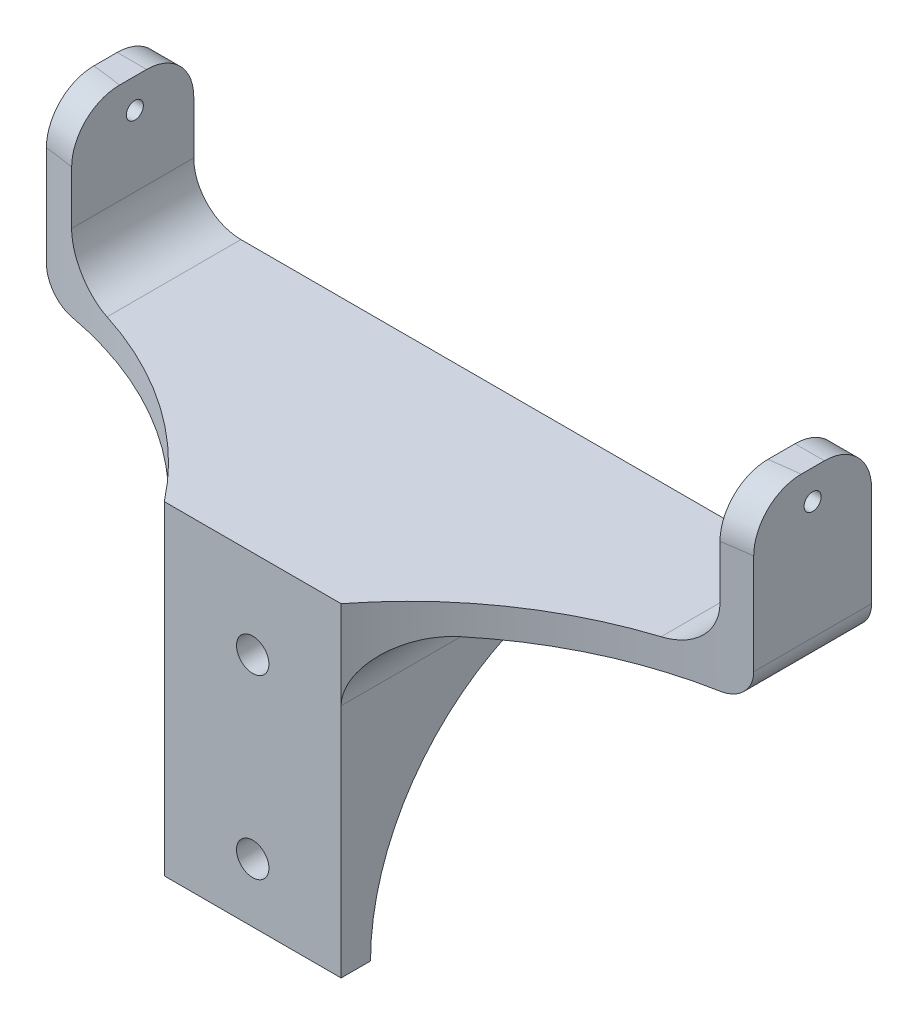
ISO-10303-21;
HEADER;
FILE_DESCRIPTION(('STEP AP214'),'2;1');
FILE_NAME('part.step','',(''),(''),'','','');
FILE_SCHEMA(('AUTOMOTIVE_DESIGN { 1 0 10303 214 1 1 1 1 }'));
ENDSEC;
DATA;
#1=APPLICATION_CONTEXT('core data for automotive mechanical design processes');
#2=APPLICATION_PROTOCOL_DEFINITION('international standard','automotive_design',2000,#1);
#3=PRODUCT_CONTEXT('',#1,'mechanical');
#4=PRODUCT('Part','Part','',(#3));
#5=PRODUCT_RELATED_PRODUCT_CATEGORY('part','',(#4));
#6=PRODUCT_DEFINITION_FORMATION('','',#4);
#7=PRODUCT_DEFINITION_CONTEXT('part definition',#1,'design');
#8=PRODUCT_DEFINITION('design','',#6,#7);
#9=PRODUCT_DEFINITION_SHAPE('','',#8);
#10=(LENGTH_UNIT() NAMED_UNIT(*) SI_UNIT(.MILLI.,.METRE.));
#11=(NAMED_UNIT(*) PLANE_ANGLE_UNIT() SI_UNIT($,.RADIAN.));
#12=(NAMED_UNIT(*) SI_UNIT($,.STERADIAN.) SOLID_ANGLE_UNIT());
#13=UNCERTAINTY_MEASURE_WITH_UNIT(LENGTH_MEASURE(1.E-05),#10,'distance_accuracy_value','');
#14=(GEOMETRIC_REPRESENTATION_CONTEXT(3) GLOBAL_UNCERTAINTY_ASSIGNED_CONTEXT((#13)) GLOBAL_UNIT_ASSIGNED_CONTEXT((#10,
#11,#12)) REPRESENTATION_CONTEXT('',''));
#15=CARTESIAN_POINT('',(0.,0.,0.));
#16=DIRECTION('',(0.,0.,1.));
#17=DIRECTION('',(1.,0.,0.));
#18=AXIS2_PLACEMENT_3D('',#15,#16,#17);
#19=CARTESIAN_POINT('',(58.5,-50.,-16.4932807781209));
#20=DIRECTION('',(-1.,0.,0.));
#21=DIRECTION('',(0.,0.,1.));
#22=AXIS2_PLACEMENT_3D('',#19,#20,#21);
#23=CYLINDRICAL_SURFACE('',#22,40.010932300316);
#24=CARTESIAN_POINT('',(-16.5,-50.,-16.4932807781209));
#25=DIRECTION('',(-1.,0.,0.));
#26=DIRECTION('',(0.,0.,1.));
#27=AXIS2_PLACEMENT_3D('',#24,#25,#26);
#28=CIRCLE('',#27,40.010932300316);
#29=CARTESIAN_POINT('',(-16.5,-50.,23.5176515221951));
#30=VERTEX_POINT('',#29);
#31=CARTESIAN_POINT('',(-16.5,-10.0344336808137,-14.5884940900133));
#32=VERTEX_POINT('',#31);
#33=EDGE_CURVE('E280',#30,#32,#28,.T.);
#34=ORIENTED_EDGE('',*,*,#33,.T.);
#35=DIRECTION('',(-1.,0.,0.));
#36=VECTOR('',#35,1.);
#37=CARTESIAN_POINT('',(58.5,-10.0344336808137,-14.5884940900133));
#38=LINE('',#37,#36);
#39=CARTESIAN_POINT('',(-11.5,-10.0344336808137,-14.5884940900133));
#40=VERTEX_POINT('',#39);
#41=EDGE_CURVE('E517',#32,#40,#38,.F.);
#42=ORIENTED_EDGE('',*,*,#41,.T.);
#43=CARTESIAN_POINT('',(-11.5,-50.,-16.4932807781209));
#44=DIRECTION('',(-1.,0.,0.));
#45=DIRECTION('',(0.,0.,1.));
#46=AXIS2_PLACEMENT_3D('',#43,#44,#45);
#47=CIRCLE('',#46,40.010932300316);
#48=CARTESIAN_POINT('',(-11.5,-50.,23.5176515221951));
#49=VERTEX_POINT('',#48);
#50=EDGE_CURVE('E533',#40,#49,#47,.F.);
#51=ORIENTED_EDGE('',*,*,#50,.T.);
#52=DIRECTION('',(-1.,0.,0.));
#53=VECTOR('',#52,1.);
#54=CARTESIAN_POINT('',(58.5,-50.,23.5176515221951));
#55=LINE('',#54,#53);
#56=EDGE_CURVE('E608',#49,#30,#55,.T.);
#57=ORIENTED_EDGE('',*,*,#56,.T.);
#58=EDGE_LOOP('',(#34,#42,#51,#57));
#59=FACE_BOUND('',#58,.T.);
#60=ADVANCED_FACE('F39',(#59),#23,.F.);
#61=CARTESIAN_POINT('',(65.3441664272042,0.,68.8262187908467));
#62=DIRECTION('',(0.,1.,0.));
#63=DIRECTION('',(0.,0.,1.));
#64=AXIS2_PLACEMENT_3D('',#61,#62,#63);
#65=PLANE('',#64);
#66=DIRECTION('',(-1.,0.,0.));
#67=VECTOR('',#66,1.);
#68=CARTESIAN_POINT('',(-56.5,0.,-16.4932807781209));
#69=LINE('',#68,#67);
#70=CARTESIAN_POINT('',(-26.5,0.,-16.4932807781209));
#71=VERTEX_POINT('',#70);
#72=CARTESIAN_POINT('',(-56.5,0.,-16.4932807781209));
#73=VERTEX_POINT('',#72);
#74=EDGE_CURVE('E328',#71,#73,#69,.T.);
#75=ORIENTED_EDGE('',*,*,#74,.F.);
#76=DIRECTION('',(0.,0.,-1.));
#77=VECTOR('',#76,1.);
#78=CARTESIAN_POINT('',(-26.5,0.,28.5067192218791));
#79=LINE('',#78,#77);
#80=CARTESIAN_POINT('',(-26.5,0.,18.2046287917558));
#81=VERTEX_POINT('',#80);
#82=EDGE_CURVE('E475',#71,#81,#79,.F.);
#83=ORIENTED_EDGE('',*,*,#82,.T.);
#84=CARTESIAN_POINT('',(-68.3441664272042,0.,68.8262187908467));
#85=DIRECTION('',(0.,-1.,0.));
#86=DIRECTION('',(0.,0.,-1.));
#87=AXIS2_PLACEMENT_3D('',#84,#85,#86);
#88=CIRCLE('',#87,65.6770860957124);
#89=CARTESIAN_POINT('',(-56.5,0.,4.22594510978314));
#90=VERTEX_POINT('',#89);
#91=EDGE_CURVE('E340',#90,#81,#88,.T.);
#92=ORIENTED_EDGE('',*,*,#91,.F.);
#93=DIRECTION('',(0.,0.,1.));
#94=VECTOR('',#93,1.);
#95=CARTESIAN_POINT('',(-56.5,0.,68.8262187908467));
#96=LINE('',#95,#94);
#97=EDGE_CURVE('E467',#90,#73,#96,.F.);
#98=ORIENTED_EDGE('',*,*,#97,.T.);
#99=EDGE_LOOP('',(#75,#83,#92,#98));
#100=FACE_BOUND('',#99,.T.);
#101=ADVANCED_FACE('F550',(#100),#65,.F.);
#102=CARTESIAN_POINT('',(65.3441664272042,0.,68.8262187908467));
#103=DIRECTION('',(0.,-1.,0.));
#104=DIRECTION('',(0.,0.,1.));
#105=AXIS2_PLACEMENT_3D('',#102,#103,#104);
#106=CIRCLE('',#105,65.6770860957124);
#107=CARTESIAN_POINT('',(23.5,0.,18.2046287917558));
#108=VERTEX_POINT('',#107);
#109=CARTESIAN_POINT('',(53.5,0.,4.22594510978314));
#110=VERTEX_POINT('',#109);
#111=EDGE_CURVE('E333',#108,#110,#106,.T.);
#112=ORIENTED_EDGE('',*,*,#111,.F.);
#113=DIRECTION('',(0.,0.,1.));
#114=VECTOR('',#113,1.);
#115=CARTESIAN_POINT('',(23.5,0.,-16.4932807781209));
#116=LINE('',#115,#114);
#117=CARTESIAN_POINT('',(23.5,0.,-16.4932807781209));
#118=VERTEX_POINT('',#117);
#119=EDGE_CURVE('E479',#108,#118,#116,.F.);
#120=ORIENTED_EDGE('',*,*,#119,.T.);
#121=CARTESIAN_POINT('',(53.5,0.,-16.4932807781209));
#122=VERTEX_POINT('',#121);
#123=EDGE_CURVE('E337',#122,#118,#69,.T.);
#124=ORIENTED_EDGE('',*,*,#123,.F.);
#125=DIRECTION('',(0.,0.,-1.));
#126=VECTOR('',#125,1.);
#127=CARTESIAN_POINT('',(53.5,0.,68.8262187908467));
#128=LINE('',#127,#126);
#129=EDGE_CURVE('E442',#122,#110,#128,.F.);
#130=ORIENTED_EDGE('',*,*,#129,.T.);
#131=EDGE_LOOP('',(#112,#120,#124,#130));
#132=FACE_BOUND('',#131,.T.);
#133=ADVANCED_FACE('F624',(#132),#65,.F.);
#134=CARTESIAN_POINT('',(-68.3441664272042,30.,68.8262187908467));
#135=DIRECTION('',(0.,-1.,0.));
#136=DIRECTION('',(0.,0.,-1.));
#137=AXIS2_PLACEMENT_3D('',#134,#135,#136);
#138=CYLINDRICAL_SURFACE('',#137,65.6770860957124);
#139=DIRECTION('',(0.,-1.,0.));
#140=VECTOR('',#139,1.);
#141=CARTESIAN_POINT('',(-61.5,30.,3.50671922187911));
#142=LINE('',#141,#140);
#143=CARTESIAN_POINT('',(-61.5,22.,3.50671922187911));
#144=VERTEX_POINT('',#143);
#145=CARTESIAN_POINT('',(-61.5,5.,3.50671922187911));
#146=VERTEX_POINT('',#145);
#147=EDGE_CURVE('E354',#144,#146,#142,.T.);
#148=ORIENTED_EDGE('',*,*,#147,.T.);
#149=CARTESIAN_POINT('',(-61.5,5.,3.50671922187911));
#150=CARTESIAN_POINT('',(-61.500015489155,4.86005519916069,3.50672099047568));
#151=CARTESIAN_POINT('',(-61.4941252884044,4.72011263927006,3.50733487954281));
#152=CARTESIAN_POINT('',(-61.4706453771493,4.44123034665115,3.50979969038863));
#153=CARTESIAN_POINT('',(-61.4530562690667,4.30229056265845,3.51165054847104));
#154=CARTESIAN_POINT('',(-61.4063098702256,4.02651246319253,3.51660002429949));
#155=CARTESIAN_POINT('',(-61.3771622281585,3.88967249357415,3.51969760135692));
#156=CARTESIAN_POINT('',(-61.307518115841,3.6189490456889,3.52716479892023));
#157=CARTESIAN_POINT('',(-61.2670217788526,3.4850655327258,3.53153440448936));
#158=CARTESIAN_POINT('',(-61.1749636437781,3.22116591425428,3.54157810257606));
#159=CARTESIAN_POINT('',(-61.1233986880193,3.09115092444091,3.5472525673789));
#160=CARTESIAN_POINT('',(-61.0095694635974,2.83590263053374,3.55994415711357));
#161=CARTESIAN_POINT('',(-60.9473012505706,2.71067111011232,3.56696177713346));
#162=CARTESIAN_POINT('',(-60.8125740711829,2.46599141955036,3.58237351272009));
#163=CARTESIAN_POINT('',(-60.7401205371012,2.34654021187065,3.59076689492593));
#164=CARTESIAN_POINT('',(-60.585503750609,2.11414753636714,3.60897528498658));
#165=CARTESIAN_POINT('',(-60.5033369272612,2.00120848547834,3.61879081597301));
#166=CARTESIAN_POINT('',(-60.3298582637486,1.78259869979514,3.63988479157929));
#167=CARTESIAN_POINT('',(-60.2385398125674,1.6769333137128,3.65116429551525));
#168=CARTESIAN_POINT('',(-60.047446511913,1.47365771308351,3.67521457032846));
#169=CARTESIAN_POINT('',(-59.9476685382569,1.37605050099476,3.68798589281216));
#170=CARTESIAN_POINT('',(-59.7404426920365,1.18962584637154,3.71503319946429));
#171=CARTESIAN_POINT('',(-59.6329964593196,1.1008065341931,3.72930886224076));
#172=CARTESIAN_POINT('',(-59.4111638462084,0.932504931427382,3.75937905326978));
#173=CARTESIAN_POINT('',(-59.2967749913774,0.853025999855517,3.77517412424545));
#174=CARTESIAN_POINT('',(-59.0613696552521,0.703616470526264,3.80834806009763));
#175=CARTESIAN_POINT('',(-58.9403243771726,0.633732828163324,3.82573406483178));
#176=CARTESIAN_POINT('',(-58.6929890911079,0.504415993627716,3.86199758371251));
#177=CARTESIAN_POINT('',(-58.5666989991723,0.444982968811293,3.88087512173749));
#178=CARTESIAN_POINT('',(-58.3098160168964,0.336956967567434,3.92006872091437));
#179=CARTESIAN_POINT('',(-58.1792242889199,0.288361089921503,3.94038439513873));
#180=CARTESIAN_POINT('',(-57.9146904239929,0.202291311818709,3.98237850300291));
#181=CARTESIAN_POINT('',(-57.7807489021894,0.164815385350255,4.00405668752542));
#182=CARTESIAN_POINT('',(-57.4575322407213,0.0887486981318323,4.05742194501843));
#183=CARTESIAN_POINT('',(-57.2670744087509,0.0554374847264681,4.08971173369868));
#184=CARTESIAN_POINT('',(-56.9800012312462,0.0221603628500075,4.13970664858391));
#185=CARTESIAN_POINT('',(-56.8841319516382,0.0138495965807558,4.15662197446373));
#186=CARTESIAN_POINT('',(-56.6921703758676,0.00277043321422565,4.19093326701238));
#187=CARTESIAN_POINT('',(-56.5960781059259,1.41455798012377E-06,4.208329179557));
#188=CARTESIAN_POINT('',(-56.5,0.,4.22594510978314));
#189=B_SPLINE_CURVE_WITH_KNOTS('',3,(#149,#150,#151,#152,#153,#154,#155,#156,#157,#158,#159,
#160,#161,#162,#163,#164,#165,#166,#167,#168,#169,#170,#171,#172,#173,#174,#175,#176,#177,#178,
#179,#180,#181,#182,#183,#184,#185,#186,#187,#188),.UNSPECIFIED.,.F.,.F.,(4,2,2,2,2,2,2,2,2,2,2,
2,2,2,2,2,2,2,2,4),(0.,0.419705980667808,0.839390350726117,1.25872511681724,1.67805495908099,
2.09750458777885,2.51710912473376,2.93649071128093,3.35602695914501,3.77586848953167,
4.19586575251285,4.61577346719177,5.03583173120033,5.45787742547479,5.8799298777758,
6.30186920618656,6.72373161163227,7.3103339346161,7.60331455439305,7.89626231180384),.UNSPECIFIED.);
#190=EDGE_CURVE('E461',#146,#90,#189,.T.);
#191=ORIENTED_EDGE('',*,*,#190,.T.);
#192=ORIENTED_EDGE('',*,*,#91,.T.);
#193=CARTESIAN_POINT('',(-26.5,0.,18.2046287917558));
#194=CARTESIAN_POINT('',(-26.1748734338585,-4.08702403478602E-05,18.47334380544));
#195=CARTESIAN_POINT('',(-25.8524458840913,-0.0158542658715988,18.745172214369));
#196=CARTESIAN_POINT('',(-25.2146551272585,-0.07776732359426,19.293394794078));
#197=CARTESIAN_POINT('',(-24.8992892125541,-0.123855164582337,19.5697871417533));
#198=CARTESIAN_POINT('',(-24.2753374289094,-0.245390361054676,20.1272024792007));
#199=CARTESIAN_POINT('',(-23.9667978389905,-0.320996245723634,20.4082424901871));
#200=CARTESIAN_POINT('',(-23.3595359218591,-0.500643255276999,20.9719162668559));
#201=CARTESIAN_POINT('',(-23.0608152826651,-0.604689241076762,21.2545502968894));
#202=CARTESIAN_POINT('',(-22.429294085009,-0.858754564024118,21.8632032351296));
#203=CARTESIAN_POINT('',(-22.098321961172,-1.01338438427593,22.1892062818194));
#204=CARTESIAN_POINT('',(-21.4528557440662,-1.35937087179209,22.8382407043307));
#205=CARTESIAN_POINT('',(-21.1383659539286,-1.55073706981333,23.1612712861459));
#206=CARTESIAN_POINT('',(-20.5285291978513,-1.97016299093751,23.8002354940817));
#207=CARTESIAN_POINT('',(-20.2331488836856,-2.1981562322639,24.1161808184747));
#208=CARTESIAN_POINT('',(-19.6635307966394,-2.692145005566,24.7370764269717));
#209=CARTESIAN_POINT('',(-19.3892795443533,-2.95811599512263,25.0420336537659));
#210=CARTESIAN_POINT('',(-18.9739194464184,-3.4114041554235,25.5121077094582));
#211=CARTESIAN_POINT('',(-18.8247387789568,-3.58563201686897,25.6827977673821));
#212=CARTESIAN_POINT('',(-18.5356984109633,-3.94825090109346,26.0168173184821));
#213=CARTESIAN_POINT('',(-18.3958361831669,-4.13663805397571,26.1801488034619));
#214=CARTESIAN_POINT('',(-18.1266231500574,-4.52799015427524,26.4974905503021));
#215=CARTESIAN_POINT('',(-17.9972646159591,-4.73094417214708,26.6515076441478));
#216=CARTESIAN_POINT('',(-17.7504281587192,-5.15184794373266,26.94793634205));
#217=CARTESIAN_POINT('',(-17.632947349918,-5.36979403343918,27.0903507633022));
#218=CARTESIAN_POINT('',(-17.3532456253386,-5.93998048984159,27.4320590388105));
#219=CARTESIAN_POINT('',(-17.1999382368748,-6.30262817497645,27.6219363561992));
#220=CARTESIAN_POINT('',(-16.9998780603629,-6.87142008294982,27.8719126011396));
#221=CARTESIAN_POINT('',(-16.9382311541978,-7.064906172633,27.9493589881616));
#222=CARTESIAN_POINT('',(-16.8258695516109,-7.45967800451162,28.0910636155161));
#223=CARTESIAN_POINT('',(-16.7751477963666,-7.66095861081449,28.155330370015));
#224=CARTESIAN_POINT('',(-16.6932294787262,-8.03590943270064,28.2594345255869));
#225=CARTESIAN_POINT('',(-16.6601846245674,-8.20854318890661,28.3015617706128));
#226=CARTESIAN_POINT('',(-16.6029940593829,-8.55759157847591,28.37460745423));
#227=CARTESIAN_POINT('',(-16.5788459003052,-8.73400515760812,28.405528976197));
#228=CARTESIAN_POINT('',(-16.5397498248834,-9.09119239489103,28.4556460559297));
#229=CARTESIAN_POINT('',(-16.5248887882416,-9.27199125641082,28.4747308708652));
#230=CARTESIAN_POINT('',(-16.5049903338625,-9.63518097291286,28.5003026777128));
#231=CARTESIAN_POINT('',(-16.4999621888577,-9.81757316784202,28.5067777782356));
#232=CARTESIAN_POINT('',(-16.5,-10.,28.5067192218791));
#233=B_SPLINE_CURVE_WITH_KNOTS('',3,(#193,#194,#195,#196,#197,#198,#199,#200,#201,#202,#203,
#204,#205,#206,#207,#208,#209,#210,#211,#212,#213,#214,#215,#216,#217,#218,#219,#220,#221,#222,
#223,#224,#225,#226,#227,#228,#229,#230,#231,#232),.UNSPECIFIED.,.F.,.F.,(4,2,2,2,2,2,2,2,2,2,2,
2,2,2,2,2,2,2,2,4),(0.,1.2649451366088,2.52939665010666,3.80073454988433,5.07228987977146,
6.53949522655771,8.00708173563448,9.47203391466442,10.9360436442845,11.793275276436,
12.6502734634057,13.5066352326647,14.3627884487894,15.6686554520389,16.3200216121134,
16.970965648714,17.5126477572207,18.0541807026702,18.6007066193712,19.1477476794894),.UNSPECIFIED.);
#234=CARTESIAN_POINT('',(-16.5,-10.,28.5067192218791));
#235=VERTEX_POINT('',#234);
#236=EDGE_CURVE('E483',#81,#235,#233,.T.);
#237=ORIENTED_EDGE('',*,*,#236,.T.);
#238=DIRECTION('',(0.,-1.,0.));
#239=VECTOR('',#238,1.);
#240=CARTESIAN_POINT('',(-16.5,30.,28.5067192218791));
#241=LINE('',#240,#239);
#242=CARTESIAN_POINT('',(-16.5,5.,28.5067192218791));
#243=VERTEX_POINT('',#242);
#244=EDGE_CURVE('E352',#243,#235,#241,.T.);
#245=ORIENTED_EDGE('',*,*,#244,.F.);
#246=CARTESIAN_POINT('',(-68.3441664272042,5.,68.8262187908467));
#247=DIRECTION('',(0.,-1.,0.));
#248=DIRECTION('',(0.,0.,-1.));
#249=AXIS2_PLACEMENT_3D('',#246,#247,#248);
#250=CIRCLE('',#249,65.6770860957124);
#251=CARTESIAN_POINT('',(-48.5,5.,6.21880152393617));
#252=VERTEX_POINT('',#251);
#253=EDGE_CURVE('E325',#243,#252,#250,.F.);
#254=ORIENTED_EDGE('',*,*,#253,.T.);
#255=CARTESIAN_POINT('',(-48.5,5.,6.21880152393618));
#256=CARTESIAN_POINT('',(-48.726336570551,4.99997947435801,6.14704834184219));
#257=CARTESIAN_POINT('',(-48.9530850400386,5.00960493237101,6.07654111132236));
#258=CARTESIAN_POINT('',(-49.405854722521,5.04820943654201,5.93841728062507));
#259=CARTESIAN_POINT('',(-49.63187580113,5.07719187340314,5.87080118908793));
#260=CARTESIAN_POINT('',(-50.0817524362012,5.15460525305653,5.73882711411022));
#261=CARTESIAN_POINT('',(-50.3056059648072,5.20305288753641,5.67447198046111));
#262=CARTESIAN_POINT('',(-50.7492676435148,5.31928578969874,5.54942794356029));
#263=CARTESIAN_POINT('',(-50.969076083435,5.38706966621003,5.4887387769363));
#264=CARTESIAN_POINT('',(-51.4033276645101,5.54185611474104,5.37120864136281));
#265=CARTESIAN_POINT('',(-51.6177612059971,5.62889067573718,5.31437428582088));
#266=CARTESIAN_POINT('',(-52.0391492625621,5.82169205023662,5.20489025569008));
#267=CARTESIAN_POINT('',(-52.2461038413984,5.92745870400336,5.15224054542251));
#268=CARTESIAN_POINT('',(-52.6506563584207,6.15703992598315,5.05132705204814));
#269=CARTESIAN_POINT('',(-52.848261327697,6.2808406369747,5.00305994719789));
#270=CARTESIAN_POINT('',(-53.2325886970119,6.54577092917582,4.91097093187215));
#271=CARTESIAN_POINT('',(-53.4193115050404,6.68689986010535,4.86714885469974));
#272=CARTESIAN_POINT('',(-53.774620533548,6.98087395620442,4.78529300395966));
#273=CARTESIAN_POINT('',(-53.9435905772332,7.13321706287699,4.74712142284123));
#274=CARTESIAN_POINT('',(-54.2683797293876,7.45224300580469,4.67499475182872));
#275=CARTESIAN_POINT('',(-54.4241992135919,7.61892543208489,4.64103954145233));
#276=CARTESIAN_POINT('',(-54.7214174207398,7.96550945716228,4.57730079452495));
#277=CARTESIAN_POINT('',(-54.8628122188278,8.14541463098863,4.54751839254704));
#278=CARTESIAN_POINT('',(-55.1299292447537,8.51709805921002,4.49207398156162));
#279=CARTESIAN_POINT('',(-55.255651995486,8.70887591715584,4.46641183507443));
#280=CARTESIAN_POINT('',(-55.4872929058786,9.09774253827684,4.41974364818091));
#281=CARTESIAN_POINT('',(-55.5936422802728,9.29456209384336,4.39863357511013));
#282=CARTESIAN_POINT('',(-55.7896021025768,9.69670898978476,4.36016161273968));
#283=CARTESIAN_POINT('',(-55.8792131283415,9.90203603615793,4.34279959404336));
#284=CARTESIAN_POINT('',(-56.0409208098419,10.3195902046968,4.31175089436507));
#285=CARTESIAN_POINT('',(-56.1130292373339,10.5318125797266,4.29806174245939));
#286=CARTESIAN_POINT('',(-56.2392089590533,10.961660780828,4.27427261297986));
#287=CARTESIAN_POINT('',(-56.2932853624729,11.1792850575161,4.26417161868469));
#288=CARTESIAN_POINT('',(-56.3919236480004,11.6622051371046,4.24583025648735));
#289=CARTESIAN_POINT('',(-56.4324537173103,11.9283732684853,4.2383595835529));
#290=CARTESIAN_POINT('',(-56.4729780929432,12.3294199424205,4.2309040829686));
#291=CARTESIAN_POINT('',(-56.4831077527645,12.4633218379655,4.22904399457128));
#292=CARTESIAN_POINT('',(-56.4966183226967,12.7314734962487,4.22656500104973));
#293=CARTESIAN_POINT('',(-56.4999994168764,12.8657232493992,4.22594606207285));
#294=CARTESIAN_POINT('',(-56.5,13.,4.22594510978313));
#295=B_SPLINE_CURVE_WITH_KNOTS('',3,(#255,#256,#257,#258,#259,#260,#261,#262,#263,#264,#265,
#266,#267,#268,#269,#270,#271,#272,#273,#274,#275,#276,#277,#278,#279,#280,#281,#282,#283,#284,
#285,#286,#287,#288,#289,#290,#291,#292,#293,#294),.UNSPECIFIED.,.F.,.F.,(4,2,2,2,2,2,2,2,2,2,2,
2,2,2,2,2,2,2,2,4),(0.,0.712139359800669,1.42440349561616,2.13727971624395,2.85010466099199,
3.5641231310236,4.27813551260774,4.99160211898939,5.70504195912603,6.39625267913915,
7.08744364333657,7.77882217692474,8.47017763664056,9.14349088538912,9.81678088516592,
10.4896167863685,11.162261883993,11.9686971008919,12.3714404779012,12.7741728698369),.UNSPECIFIED.);
#296=CARTESIAN_POINT('',(-56.5,13.,4.22594510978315));
#297=VERTEX_POINT('',#296);
#298=EDGE_CURVE('E381',#252,#297,#295,.T.);
#299=ORIENTED_EDGE('',*,*,#298,.T.);
#300=DIRECTION('',(0.,-1.,0.));
#301=VECTOR('',#300,1.);
#302=CARTESIAN_POINT('',(-56.5,30.,4.22594510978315));
#303=LINE('',#302,#301);
#304=CARTESIAN_POINT('',(-56.5,22.,4.22594510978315));
#305=VERTEX_POINT('',#304);
#306=EDGE_CURVE('E315',#305,#297,#303,.T.);
#307=ORIENTED_EDGE('',*,*,#306,.F.);
#308=CARTESIAN_POINT('',(-68.3441664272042,22.,68.8262187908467));
#309=DIRECTION('',(0.,1.,0.));
#310=DIRECTION('',(0.,0.,1.));
#311=AXIS2_PLACEMENT_3D('',#308,#309,#310);
#312=CIRCLE('',#311,65.6770860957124);
#313=EDGE_CURVE('E671',#305,#144,#312,.T.);
#314=ORIENTED_EDGE('',*,*,#313,.T.);
#315=EDGE_LOOP('',(#148,#191,#192,#237,#245,#254,#299,#307,#314));
#316=FACE_BOUND('',#315,.T.);
#317=ADVANCED_FACE('F392',(#316),#138,.F.);
#318=CARTESIAN_POINT('',(65.3441664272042,30.,68.8262187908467));
#319=DIRECTION('',(0.,1.,0.));
#320=DIRECTION('',(0.,0.,1.));
#321=AXIS2_PLACEMENT_3D('',#318,#319,#320);
#322=PLANE('',#321);
#323=DIRECTION('',(0.,0.,1.));
#324=VECTOR('',#323,1.);
#325=CARTESIAN_POINT('',(-61.5,30.,-16.4932807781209));
#326=LINE('',#325,#324);
#327=CARTESIAN_POINT('',(-61.5,30.,-8.49328077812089));
#328=VERTEX_POINT('',#327);
#329=CARTESIAN_POINT('',(-61.5,30.,-4.53228720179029));
#330=VERTEX_POINT('',#329);
#331=EDGE_CURVE('E329',#328,#330,#326,.T.);
#332=ORIENTED_EDGE('',*,*,#331,.T.);
#333=CARTESIAN_POINT('',(-68.3441664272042,30.,68.8262187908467));
#334=DIRECTION('',(0.,1.,0.));
#335=DIRECTION('',(0.,0.,1.));
#336=AXIS2_PLACEMENT_3D('',#333,#334,#335);
#337=CIRCLE('',#336,73.6770860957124);
#338=CARTESIAN_POINT('',(-56.5,30.,-3.89261465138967));
#339=VERTEX_POINT('',#338);
#340=EDGE_CURVE('E695',#330,#339,#337,.F.);
#341=ORIENTED_EDGE('',*,*,#340,.T.);
#342=DIRECTION('',(0.,0.,-1.));
#343=VECTOR('',#342,1.);
#344=CARTESIAN_POINT('',(-56.5,30.,68.8262187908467));
#345=LINE('',#344,#343);
#346=CARTESIAN_POINT('',(-56.5,30.,-8.49328077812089));
#347=VERTEX_POINT('',#346);
#348=EDGE_CURVE('E360',#339,#347,#345,.T.);
#349=ORIENTED_EDGE('',*,*,#348,.T.);
#350=DIRECTION('',(-1.,0.,0.));
#351=VECTOR('',#350,1.);
#352=CARTESIAN_POINT('',(-61.5,30.,-8.49328077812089));
#353=LINE('',#352,#351);
#354=EDGE_CURVE('E418',#347,#328,#353,.T.);
#355=ORIENTED_EDGE('',*,*,#354,.T.);
#356=EDGE_LOOP('',(#332,#341,#349,#355));
#357=FACE_BOUND('',#356,.T.);
#358=ADVANCED_FACE('F622',(#357),#322,.T.);
#359=CARTESIAN_POINT('',(-56.5,30.,-16.4932807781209));
#360=DIRECTION('',(0.,0.,1.));
#361=DIRECTION('',(1.,0.,0.));
#362=AXIS2_PLACEMENT_3D('',#359,#360,#361);
#363=PLANE('',#362);
#364=DIRECTION('',(0.,-1.,0.));
#365=VECTOR('',#364,1.);
#366=CARTESIAN_POINT('',(-11.5,0.,-16.4932807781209));
#367=LINE('',#366,#365);
#368=CARTESIAN_POINT('',(-11.5,0.,-16.4932807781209));
#369=VERTEX_POINT('',#368);
#370=CARTESIAN_POINT('',(-11.5,-8.03670136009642,-16.4932807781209));
#371=VERTEX_POINT('',#370);
#372=EDGE_CURVE('E241',#369,#371,#367,.T.);
#373=ORIENTED_EDGE('',*,*,#372,.T.);
#374=DIRECTION('',(-1.,0.,0.));
#375=VECTOR('',#374,1.);
#376=CARTESIAN_POINT('',(-56.5,-8.03670136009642,-16.4932807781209));
#377=LINE('',#376,#375);
#378=CARTESIAN_POINT('',(-16.694620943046,-8.03670136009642,-16.4932807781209));
#379=VERTEX_POINT('',#378);
#380=EDGE_CURVE('E515',#371,#379,#377,.T.);
#381=ORIENTED_EDGE('',*,*,#380,.T.);
#382=CARTESIAN_POINT('',(-26.5,-10.,-16.4932807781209));
#383=DIRECTION('',(0.,0.,1.));
#384=DIRECTION('',(1.,0.,0.));
#385=AXIS2_PLACEMENT_3D('',#382,#383,#384);
#386=CIRCLE('',#385,10.);
#387=EDGE_CURVE('E481',#379,#71,#386,.T.);
#388=ORIENTED_EDGE('',*,*,#387,.T.);
#389=ORIENTED_EDGE('',*,*,#74,.T.);
#390=CARTESIAN_POINT('',(-56.5,5.,-16.4932807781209));
#391=DIRECTION('',(0.,0.,1.));
#392=DIRECTION('',(1.,0.,0.));
#393=AXIS2_PLACEMENT_3D('',#390,#391,#392);
#394=CIRCLE('',#393,5.);
#395=CARTESIAN_POINT('',(-61.5,5.,-16.4932807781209));
#396=VERTEX_POINT('',#395);
#397=EDGE_CURVE('E470',#73,#396,#394,.F.);
#398=ORIENTED_EDGE('',*,*,#397,.T.);
#399=DIRECTION('',(0.,-1.,0.));
#400=VECTOR('',#399,1.);
#401=CARTESIAN_POINT('',(-61.5,30.,-16.4932807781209));
#402=LINE('',#401,#400);
#403=CARTESIAN_POINT('',(-61.5,22.,-16.4932807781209));
#404=VERTEX_POINT('',#403);
#405=EDGE_CURVE('E357',#404,#396,#402,.T.);
#406=ORIENTED_EDGE('',*,*,#405,.F.);
#407=DIRECTION('',(-1.,0.,0.));
#408=VECTOR('',#407,1.);
#409=CARTESIAN_POINT('',(-56.5,22.,-16.4932807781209));
#410=LINE('',#409,#408);
#411=CARTESIAN_POINT('',(-56.5,22.,-16.4932807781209));
#412=VERTEX_POINT('',#411);
#413=EDGE_CURVE('E565',#404,#412,#410,.F.);
#414=ORIENTED_EDGE('',*,*,#413,.T.);
#415=DIRECTION('',(0.,-1.,0.));
#416=VECTOR('',#415,1.);
#417=CARTESIAN_POINT('',(-56.5,30.,-16.4932807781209));
#418=LINE('',#417,#416);
#419=CARTESIAN_POINT('',(-56.5,13.,-16.4932807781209));
#420=VERTEX_POINT('',#419);
#421=EDGE_CURVE('E316',#412,#420,#418,.T.);
#422=ORIENTED_EDGE('',*,*,#421,.T.);
#423=CARTESIAN_POINT('',(-48.5,13.,-16.4932807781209));
#424=DIRECTION('',(0.,0.,1.));
#425=DIRECTION('',(1.,0.,0.));
#426=AXIS2_PLACEMENT_3D('',#423,#424,#425);
#427=CIRCLE('',#426,8.);
#428=CARTESIAN_POINT('',(-48.5,5.,-16.4932807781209));
#429=VERTEX_POINT('',#428);
#430=EDGE_CURVE('E379',#420,#429,#427,.T.);
#431=ORIENTED_EDGE('',*,*,#430,.T.);
#432=DIRECTION('',(-1.,0.,0.));
#433=VECTOR('',#432,1.);
#434=CARTESIAN_POINT('',(53.5,5.,-16.4932807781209));
#435=LINE('',#434,#433);
#436=CARTESIAN_POINT('',(45.5,5.,-16.4932807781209));
#437=VERTEX_POINT('',#436);
#438=EDGE_CURVE('E318',#437,#429,#435,.T.);
#439=ORIENTED_EDGE('',*,*,#438,.F.);
#440=CARTESIAN_POINT('',(45.5,13.,-16.4932807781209));
#441=DIRECTION('',(0.,0.,1.));
#442=DIRECTION('',(1.,0.,0.));
#443=AXIS2_PLACEMENT_3D('',#440,#441,#442);
#444=CIRCLE('',#443,8.);
#445=CARTESIAN_POINT('',(53.5,13.,-16.4932807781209));
#446=VERTEX_POINT('',#445);
#447=EDGE_CURVE('E390',#437,#446,#444,.T.);
#448=ORIENTED_EDGE('',*,*,#447,.T.);
#449=DIRECTION('',(0.,-1.,0.));
#450=VECTOR('',#449,1.);
#451=CARTESIAN_POINT('',(53.5,30.,-16.4932807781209));
#452=LINE('',#451,#450);
#453=CARTESIAN_POINT('',(53.5,22.,-16.4932807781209));
#454=VERTEX_POINT('',#453);
#455=EDGE_CURVE('E311',#454,#446,#452,.T.);
#456=ORIENTED_EDGE('',*,*,#455,.F.);
#457=DIRECTION('',(-1.,0.,0.));
#458=VECTOR('',#457,1.);
#459=CARTESIAN_POINT('',(58.5,22.,-16.4932807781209));
#460=LINE('',#459,#458);
#461=CARTESIAN_POINT('',(58.5,22.,-16.4932807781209));
#462=VERTEX_POINT('',#461);
#463=EDGE_CURVE('E574',#454,#462,#460,.F.);
#464=ORIENTED_EDGE('',*,*,#463,.T.);
#465=DIRECTION('',(0.,-1.,0.));
#466=VECTOR('',#465,1.);
#467=CARTESIAN_POINT('',(58.5,30.,-16.4932807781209));
#468=LINE('',#467,#466);
#469=CARTESIAN_POINT('',(58.5,5.,-16.4932807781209));
#470=VERTEX_POINT('',#469);
#471=EDGE_CURVE('E336',#462,#470,#468,.T.);
#472=ORIENTED_EDGE('',*,*,#471,.T.);
#473=CARTESIAN_POINT('',(53.5,5.,-16.4932807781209));
#474=DIRECTION('',(0.,0.,1.));
#475=DIRECTION('',(1.,0.,0.));
#476=AXIS2_PLACEMENT_3D('',#473,#474,#475);
#477=CIRCLE('',#476,5.);
#478=EDGE_CURVE('E731',#470,#122,#477,.F.);
#479=ORIENTED_EDGE('',*,*,#478,.T.);
#480=ORIENTED_EDGE('',*,*,#123,.T.);
#481=CARTESIAN_POINT('',(23.5,-10.,-16.4932807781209));
#482=DIRECTION('',(0.,0.,1.));
#483=DIRECTION('',(1.,0.,0.));
#484=AXIS2_PLACEMENT_3D('',#481,#482,#483);
#485=CIRCLE('',#484,10.);
#486=CARTESIAN_POINT('',(13.694620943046,-8.03670136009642,-16.4932807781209));
#487=VERTEX_POINT('',#486);
#488=EDGE_CURVE('E495',#118,#487,#485,.T.);
#489=ORIENTED_EDGE('',*,*,#488,.T.);
#490=DIRECTION('',(-1.,0.,0.));
#491=VECTOR('',#490,1.);
#492=CARTESIAN_POINT('',(-56.5,-8.03670136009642,-16.4932807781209));
#493=LINE('',#492,#491);
#494=CARTESIAN_POINT('',(8.5,-8.03670136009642,-16.4932807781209));
#495=VERTEX_POINT('',#494);
#496=EDGE_CURVE('E536',#487,#495,#493,.T.);
#497=ORIENTED_EDGE('',*,*,#496,.T.);
#498=DIRECTION('',(0.,-1.,0.));
#499=VECTOR('',#498,1.);
#500=CARTESIAN_POINT('',(8.5,0.,-16.4932807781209));
#501=LINE('',#500,#499);
#502=CARTESIAN_POINT('',(8.5,0.,-16.4932807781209));
#503=VERTEX_POINT('',#502);
#504=EDGE_CURVE('E254',#503,#495,#501,.T.);
#505=ORIENTED_EDGE('',*,*,#504,.F.);
#506=DIRECTION('',(1.,0.,0.));
#507=VECTOR('',#506,1.);
#508=CARTESIAN_POINT('',(-11.5,0.,-16.4932807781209));
#509=LINE('',#508,#507);
#510=EDGE_CURVE('E261',#369,#503,#509,.T.);
#511=ORIENTED_EDGE('',*,*,#510,.F.);
#512=EDGE_LOOP('',(#373,#381,#388,#389,#398,#406,#414,#422,#431,#439,#448,#456,#464,#472,#479,
#480,#489,#497,#505,#511));
#513=FACE_BOUND('',#512,.T.);
#514=ADVANCED_FACE('F266',(#513),#363,.F.);
#515=CARTESIAN_POINT('',(-61.5,30.,-16.4932807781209));
#516=DIRECTION('',(1.,0.,0.));
#517=DIRECTION('',(0.,0.,-1.));
#518=AXIS2_PLACEMENT_3D('',#515,#516,#517);
#519=PLANE('',#518);
#520=CARTESIAN_POINT('',(-61.5,25.,-6.49328077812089));
#521=DIRECTION('',(-1.,0.,0.));
#522=DIRECTION('',(0.,0.,1.));
#523=AXIS2_PLACEMENT_3D('',#520,#521,#522);
#524=CIRCLE('',#523,1.45);
#525=CARTESIAN_POINT('',(-61.5,25.,-5.04328077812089));
#526=VERTEX_POINT('',#525);
#527=EDGE_CURVE('E301',#526,#526,#524,.T.);
#528=ORIENTED_EDGE('',*,*,#527,.F.);
#529=EDGE_LOOP('',(#528));
#530=FACE_BOUND('',#529,.T.);
#531=ORIENTED_EDGE('',*,*,#405,.T.);
#532=DIRECTION('',(0.,0.,1.));
#533=VECTOR('',#532,1.);
#534=CARTESIAN_POINT('',(-61.5,5.,-16.4932807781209));
#535=LINE('',#534,#533);
#536=EDGE_CURVE('E441',#396,#146,#535,.T.);
#537=ORIENTED_EDGE('',*,*,#536,.T.);
#538=ORIENTED_EDGE('',*,*,#147,.F.);
#539=CARTESIAN_POINT('',(-61.5,22.,3.50671922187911));
#540=CARTESIAN_POINT('',(-61.5,22.2241499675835,3.50674428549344));
#541=CARTESIAN_POINT('',(-61.5,22.4482959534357,3.49724810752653));
#542=CARTESIAN_POINT('',(-61.5,22.8949766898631,3.45939460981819));
#543=CARTESIAN_POINT('',(-61.5,23.1175115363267,3.43103842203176));
#544=CARTESIAN_POINT('',(-61.5,23.559190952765,3.3556808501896));
#545=CARTESIAN_POINT('',(-61.5,23.7783384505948,3.30869662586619));
#546=CARTESIAN_POINT('',(-61.5,24.2118944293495,3.19643689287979));
#547=CARTESIAN_POINT('',(-61.5,24.4263029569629,3.13116156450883));
#548=CARTESIAN_POINT('',(-61.5,24.8489522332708,2.98276538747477));
#549=CARTESIAN_POINT('',(-61.5,25.0571903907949,2.89963715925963));
#550=CARTESIAN_POINT('',(-61.5,25.4659396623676,2.7161577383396));
#551=CARTESIAN_POINT('',(-61.5,25.666450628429,2.61580621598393));
#552=CARTESIAN_POINT('',(-61.5,26.0583039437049,2.39862647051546));
#553=CARTESIAN_POINT('',(-61.5,26.2496475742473,2.28180055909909));
#554=CARTESIAN_POINT('',(-61.5,26.621856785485,2.03250709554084));
#555=CARTESIAN_POINT('',(-61.5,26.8027223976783,1.90003959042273));
#556=CARTESIAN_POINT('',(-61.5,27.1531366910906,1.62007990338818));
#557=CARTESIAN_POINT('',(-61.5,27.3226572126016,1.47255247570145));
#558=CARTESIAN_POINT('',(-61.5,27.64877772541,1.16374770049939));
#559=CARTESIAN_POINT('',(-61.5,27.805373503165,1.00246590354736));
#560=CARTESIAN_POINT('',(-61.5,28.1045030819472,0.667339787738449));
#561=CARTESIAN_POINT('',(-61.5,28.247036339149,0.493494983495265));
#562=CARTESIAN_POINT('',(-61.5,28.5170501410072,0.134483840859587));
#563=CARTESIAN_POINT('',(-61.5,28.6445305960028,-0.0506825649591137));
#564=CARTESIAN_POINT('',(-61.5,28.8842034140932,-0.432050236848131));
#565=CARTESIAN_POINT('',(-61.5,28.996309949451,-0.628305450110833));
#566=CARTESIAN_POINT('',(-61.5,29.2036071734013,-1.02946786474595));
#567=CARTESIAN_POINT('',(-61.5,29.2988035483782,-1.23437212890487));
#568=CARTESIAN_POINT('',(-61.5,29.471647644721,-1.65140222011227));
#569=CARTESIAN_POINT('',(-61.5,29.5492997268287,-1.86352623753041));
#570=CARTESIAN_POINT('',(-61.5,29.6865291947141,-2.29345432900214));
#571=CARTESIAN_POINT('',(-61.5,29.7461107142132,-2.51125709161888));
#572=CARTESIAN_POINT('',(-61.5,29.8640607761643,-3.02651156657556));
#573=CARTESIAN_POINT('',(-61.5,29.915033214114,-3.32570768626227));
#574=CARTESIAN_POINT('',(-61.5,29.9660055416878,-3.77699520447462));
#575=CARTESIAN_POINT('',(-61.5,29.978748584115,-3.92776629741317));
#576=CARTESIAN_POINT('',(-61.5,29.9957446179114,-4.22977439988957));
#577=CARTESIAN_POINT('',(-61.5,29.9999982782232,-4.38101137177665));
#578=CARTESIAN_POINT('',(-61.5,30.,-4.53228720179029));
#579=B_SPLINE_CURVE_WITH_KNOTS('',3,(#539,#540,#541,#542,#543,#544,#545,#546,#547,#548,#549,
#550,#551,#552,#553,#554,#555,#556,#557,#558,#559,#560,#561,#562,#563,#564,#565,#566,#567,#568,
#569,#570,#571,#572,#573,#574,#575,#576,#577,#578),.UNSPECIFIED.,.F.,.F.,(4,2,2,2,2,2,2,2,2,2,2,
2,2,2,2,2,2,2,2,4),(0.,0.672243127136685,1.3444459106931,2.01603090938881,2.68760928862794,
3.35946580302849,4.03133517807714,4.7031103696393,5.37488354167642,6.04826661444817,
6.72186835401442,7.39549613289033,8.06912792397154,8.74637932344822,9.42340255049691,
10.1002573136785,10.7769571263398,11.6852877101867,12.1390136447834,12.5927038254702),.UNSPECIFIED.);
#580=EDGE_CURVE('E579',#144,#330,#579,.T.);
#581=ORIENTED_EDGE('',*,*,#580,.T.);
#582=ORIENTED_EDGE('',*,*,#331,.F.);
#583=CARTESIAN_POINT('',(-61.5,22.,-8.49328077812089));
#584=DIRECTION('',(1.,0.,0.));
#585=DIRECTION('',(0.,0.,-1.));
#586=AXIS2_PLACEMENT_3D('',#583,#584,#585);
#587=CIRCLE('',#586,8.);
#588=EDGE_CURVE('E563',#328,#404,#587,.F.);
#589=ORIENTED_EDGE('',*,*,#588,.T.);
#590=EDGE_LOOP('',(#531,#537,#538,#581,#582,#589));
#591=FACE_BOUND('',#590,.T.);
#592=ADVANCED_FACE('F559',(#530,#591),#519,.F.);
#593=CARTESIAN_POINT('',(-16.5,30.,28.5067192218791));
#594=DIRECTION('',(0.,0.,-1.));
#595=DIRECTION('',(-1.,0.,0.));
#596=AXIS2_PLACEMENT_3D('',#593,#594,#595);
#597=PLANE('',#596);
#598=CARTESIAN_POINT('',(-1.50000000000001,-40.,28.5067192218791));
#599=DIRECTION('',(0.,0.,-1.));
#600=DIRECTION('',(-1.,0.,0.));
#601=AXIS2_PLACEMENT_3D('',#598,#599,#600);
#602=CIRCLE('',#601,2.75);
#603=CARTESIAN_POINT('',(-4.25000000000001,-40.,28.5067192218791));
#604=VERTEX_POINT('',#603);
#605=EDGE_CURVE('E277',#604,#604,#602,.T.);
#606=ORIENTED_EDGE('',*,*,#605,.T.);
#607=EDGE_LOOP('',(#606));
#608=FACE_BOUND('',#607,.T.);
#609=CARTESIAN_POINT('',(-1.50000000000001,-10.,28.5067192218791));
#610=DIRECTION('',(0.,0.,-1.));
#611=DIRECTION('',(-1.,0.,0.));
#612=AXIS2_PLACEMENT_3D('',#609,#610,#611);
#613=CIRCLE('',#612,2.75);
#614=CARTESIAN_POINT('',(-4.25000000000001,-10.,28.5067192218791));
#615=VERTEX_POINT('',#614);
#616=EDGE_CURVE('E766',#615,#615,#613,.T.);
#617=ORIENTED_EDGE('',*,*,#616,.T.);
#618=EDGE_LOOP('',(#617));
#619=FACE_BOUND('',#618,.T.);
#620=DIRECTION('',(0.,-1.,0.));
#621=VECTOR('',#620,1.);
#622=CARTESIAN_POINT('',(13.5,30.,28.5067192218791));
#623=LINE('',#622,#621);
#624=CARTESIAN_POINT('',(13.5,5.,28.5067192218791));
#625=VERTEX_POINT('',#624);
#626=CARTESIAN_POINT('',(13.5,-10.,28.5067192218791));
#627=VERTEX_POINT('',#626);
#628=EDGE_CURVE('E349',#625,#627,#623,.T.);
#629=ORIENTED_EDGE('',*,*,#628,.F.);
#630=DIRECTION('',(-1.,0.,0.));
#631=VECTOR('',#630,1.);
#632=CARTESIAN_POINT('',(53.5,5.,28.5067192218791));
#633=LINE('',#632,#631);
#634=EDGE_CURVE('E312',#625,#243,#633,.T.);
#635=ORIENTED_EDGE('',*,*,#634,.T.);
#636=ORIENTED_EDGE('',*,*,#244,.T.);
#637=DIRECTION('',(0.,1.,0.));
#638=VECTOR('',#637,1.);
#639=CARTESIAN_POINT('',(-16.5,-50.,28.5067192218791));
#640=LINE('',#639,#638);
#641=CARTESIAN_POINT('',(-16.5,-50.,28.5067192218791));
#642=VERTEX_POINT('',#641);
#643=EDGE_CURVE('E295',#642,#235,#640,.T.);
#644=ORIENTED_EDGE('',*,*,#643,.F.);
#645=DIRECTION('',(-1.,0.,0.));
#646=VECTOR('',#645,1.);
#647=CARTESIAN_POINT('',(-16.5,-50.,28.5067192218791));
#648=LINE('',#647,#646);
#649=CARTESIAN_POINT('',(13.5,-50.,28.5067192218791));
#650=VERTEX_POINT('',#649);
#651=EDGE_CURVE('E293',#650,#642,#648,.T.);
#652=ORIENTED_EDGE('',*,*,#651,.F.);
#653=DIRECTION('',(0.,1.,0.));
#654=VECTOR('',#653,1.);
#655=CARTESIAN_POINT('',(13.5,-50.,28.5067192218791));
#656=LINE('',#655,#654);
#657=EDGE_CURVE('E298',#650,#627,#656,.T.);
#658=ORIENTED_EDGE('',*,*,#657,.T.);
#659=EDGE_LOOP('',(#629,#635,#636,#644,#652,#658));
#660=FACE_BOUND('',#659,.T.);
#661=ADVANCED_FACE('F425',(#608,#619,#660),#597,.F.);
#662=CARTESIAN_POINT('',(65.3441664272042,30.,68.8262187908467));
#663=DIRECTION('',(0.,-1.,0.));
#664=DIRECTION('',(0.,0.,-1.));
#665=AXIS2_PLACEMENT_3D('',#662,#663,#664);
#666=CYLINDRICAL_SURFACE('',#665,65.6770860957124);
#667=ORIENTED_EDGE('',*,*,#628,.T.);
#668=CARTESIAN_POINT('',(13.5,-10.,28.5067192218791));
#669=CARTESIAN_POINT('',(13.4999977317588,-9.89354384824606,28.5067230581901));
#670=CARTESIAN_POINT('',(13.5017005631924,-9.78710754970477,28.5045324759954));
#671=CARTESIAN_POINT('',(13.5084896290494,-9.57453216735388,28.4958047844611));
#672=CARTESIAN_POINT('',(13.5135755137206,-9.46839305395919,28.4892681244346));
#673=CARTESIAN_POINT('',(13.5338444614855,-9.15114451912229,28.4632321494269));
#674=CARTESIAN_POINT('',(13.55403901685,-8.94083029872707,28.4373065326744));
#675=CARTESIAN_POINT('',(13.6068799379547,-8.52720027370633,28.3696418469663));
#676=CARTESIAN_POINT('',(13.639365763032,-8.323829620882,28.3281067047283));
#677=CARTESIAN_POINT('',(13.715982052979,-7.92281979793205,28.2304793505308));
#678=CARTESIAN_POINT('',(13.7601160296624,-7.72518237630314,28.1743827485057));
#679=CARTESIAN_POINT('',(13.8587651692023,-7.33799321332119,28.0495175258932));
#680=CARTESIAN_POINT('',(13.9132186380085,-7.14840122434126,27.9808242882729));
#681=CARTESIAN_POINT('',(14.0316591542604,-6.77687099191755,27.8321301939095));
#682=CARTESIAN_POINT('',(14.0956456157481,-6.59493227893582,27.7521300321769));
#683=CARTESIAN_POINT('',(14.3009516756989,-6.05999389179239,27.4968420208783));
#684=CARTESIAN_POINT('',(14.4553284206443,-5.71897239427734,27.3066365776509));
#685=CARTESIAN_POINT('',(14.7580463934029,-5.13546781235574,26.9386419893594));
#686=CARTESIAN_POINT('',(14.9013752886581,-4.8869482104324,26.7660285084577));
#687=CARTESIAN_POINT('',(15.2033744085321,-4.41022425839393,26.4064626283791));
#688=CARTESIAN_POINT('',(15.3620525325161,-4.18203048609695,26.219502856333));
#689=CARTESIAN_POINT('',(15.6929668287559,-3.74495858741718,25.8343284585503));
#690=CARTESIAN_POINT('',(15.8652289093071,-3.53611910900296,25.6360925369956));
#691=CARTESIAN_POINT('',(16.2214750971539,-3.13745591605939,25.2313386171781));
#692=CARTESIAN_POINT('',(16.4054586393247,-2.9476312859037,25.0248210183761));
#693=CARTESIAN_POINT('',(16.8627451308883,-2.51105965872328,24.518305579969));
#694=CARTESIAN_POINT('',(17.141360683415,-2.27349087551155,24.215164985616));
#695=CARTESIAN_POINT('',(17.7171638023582,-1.83359962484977,23.600941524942));
#696=CARTESIAN_POINT('',(18.0143591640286,-1.6312920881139,23.2898553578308));
#697=CARTESIAN_POINT('',(18.6251423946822,-1.26139742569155,22.6634225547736));
#698=CARTESIAN_POINT('',(18.938725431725,-1.09380013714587,22.3480771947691));
#699=CARTESIAN_POINT('',(19.5805698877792,-0.793286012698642,21.7159686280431));
#700=CARTESIAN_POINT('',(19.9088275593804,-0.660360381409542,21.3992058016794));
#701=CARTESIAN_POINT('',(20.5020414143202,-0.456052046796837,20.8388249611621));
#702=CARTESIAN_POINT('',(20.7643694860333,-0.377547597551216,20.5949938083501));
#703=CARTESIAN_POINT('',(21.295974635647,-0.242055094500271,20.1090133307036));
#704=CARTESIAN_POINT('',(21.5652503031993,-0.185062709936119,19.8668636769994));
#705=CARTESIAN_POINT('',(22.1092055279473,-0.0933563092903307,19.385859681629));
#706=CARTESIAN_POINT('',(22.3838691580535,-0.0585845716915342,19.1469983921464));
#707=CARTESIAN_POINT('',(22.9383504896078,-0.0119133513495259,18.672852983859));
#708=CARTESIAN_POINT('',(23.2181700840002,-2.24450026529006E-05,18.4375702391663));
#709=CARTESIAN_POINT('',(23.5,0.,18.2046287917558));
#710=B_SPLINE_CURVE_WITH_KNOTS('',3,(#668,#669,#670,#671,#672,#673,#674,#675,#676,#677,#678,
#679,#680,#681,#682,#683,#684,#685,#686,#687,#688,#689,#690,#691,#692,#693,#694,#695,#696,#697,
#698,#699,#700,#701,#702,#703,#704,#705,#706,#707,#708,#709),.UNSPECIFIED.,.F.,.F.,(4,2,2,2,2,2,
2,2,2,2,2,2,2,2,2,2,2,2,2,2,4),(0.,0.319293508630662,0.638554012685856,1.27595962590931,
1.90531220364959,2.53485474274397,3.16074602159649,3.78659884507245,5.04185727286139,
6.04506664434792,7.04879508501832,8.05448649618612,9.06012945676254,10.4841958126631,
11.9088637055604,13.3331138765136,14.757002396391,15.8562986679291,16.9553735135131,
18.0515816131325,19.1482005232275),.UNSPECIFIED.);
#711=EDGE_CURVE('E489',#627,#108,#710,.T.);
#712=ORIENTED_EDGE('',*,*,#711,.T.);
#713=ORIENTED_EDGE('',*,*,#111,.T.);
#714=CARTESIAN_POINT('',(53.5,0.,4.22594510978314));
#715=CARTESIAN_POINT('',(53.6408336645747,-1.43624039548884E-05,4.20011916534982));
#716=CARTESIAN_POINT('',(53.7817555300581,0.00594974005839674,4.17476238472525));
#717=CARTESIAN_POINT('',(54.0627864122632,0.0297766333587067,4.12513456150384));
#718=CARTESIAN_POINT('',(54.2028954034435,0.0476397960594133,4.10086355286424));
#719=CARTESIAN_POINT('',(54.4812727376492,0.0952015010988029,4.05356135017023));
#720=CARTESIAN_POINT('',(54.6195414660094,0.12489752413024,4.03052989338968));
#721=CARTESIAN_POINT('',(54.8932659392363,0.195960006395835,3.98581829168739));
#722=CARTESIAN_POINT('',(55.0287217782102,0.237326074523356,3.9641381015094));
#723=CARTESIAN_POINT('',(55.2959290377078,0.331518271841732,3.92220604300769));
#724=CARTESIAN_POINT('',(55.427677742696,0.384352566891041,3.90195520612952));
#725=CARTESIAN_POINT('',(55.6864384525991,0.501150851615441,3.86295951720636));
#726=CARTESIAN_POINT('',(55.8134486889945,0.565118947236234,3.84421522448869));
#727=CARTESIAN_POINT('',(56.0616335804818,0.703697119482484,3.80829868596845));
#728=CARTESIAN_POINT('',(56.1828124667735,0.778299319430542,3.79112529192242));
#729=CARTESIAN_POINT('',(56.4185562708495,0.937699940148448,3.75835198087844));
#730=CARTESIAN_POINT('',(56.5331189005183,1.02250185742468,3.74275260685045));
#731=CARTESIAN_POINT('',(56.7535188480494,1.20072579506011,3.71329654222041));
#732=CARTESIAN_POINT('',(56.8594365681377,1.29404560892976,3.69942295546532));
#733=CARTESIAN_POINT('',(57.0630991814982,1.48941098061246,3.67321343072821));
#734=CARTESIAN_POINT('',(57.1608441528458,1.5914564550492,3.66087747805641));
#735=CARTESIAN_POINT('',(57.3474604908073,1.80359378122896,3.63771382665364));
#736=CARTESIAN_POINT('',(57.4363283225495,1.91368880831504,3.62688672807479));
#737=CARTESIAN_POINT('',(57.6044431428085,2.14106147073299,3.60671642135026));
#738=CARTESIAN_POINT('',(57.6836935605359,2.25833652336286,3.597372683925));
#739=CARTESIAN_POINT('',(57.8313841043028,2.49824342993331,3.58019804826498));
#740=CARTESIAN_POINT('',(57.899909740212,2.62082178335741,3.57235505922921));
#741=CARTESIAN_POINT('',(58.0264136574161,2.87132389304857,3.55804749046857));
#742=CARTESIAN_POINT('',(58.0843958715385,2.99924563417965,3.55158239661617));
#743=CARTESIAN_POINT('',(58.1893948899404,3.25952396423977,3.53998995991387));
#744=CARTESIAN_POINT('',(58.2364155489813,3.39187897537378,3.53486214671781));
#745=CARTESIAN_POINT('',(58.3191563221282,3.66006298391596,3.52590794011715));
#746=CARTESIAN_POINT('',(58.3548793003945,3.79589109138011,3.52208121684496));
#747=CARTESIAN_POINT('',(58.4230883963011,4.10819674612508,3.51481219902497));
#748=CARTESIAN_POINT('',(58.4519297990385,4.28550153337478,3.51177078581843));
#749=CARTESIAN_POINT('',(58.480768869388,4.55281061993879,3.50873652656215));
#750=CARTESIAN_POINT('',(58.4879780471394,4.64209162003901,3.50797974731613));
#751=CARTESIAN_POINT('',(58.4975930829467,4.82090818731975,3.50697135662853));
#752=CARTESIAN_POINT('',(58.4999992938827,4.91044373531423,3.50671970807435));
#753=CARTESIAN_POINT('',(58.5,5.,3.50671922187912));
#754=B_SPLINE_CURVE_WITH_KNOTS('',3,(#714,#715,#716,#717,#718,#719,#720,#721,#722,#723,#724,
#725,#726,#727,#728,#729,#730,#731,#732,#733,#734,#735,#736,#737,#738,#739,#740,#741,#742,#743,
#744,#745,#746,#747,#748,#749,#750,#751,#752,#753),.UNSPECIFIED.,.F.,.F.,(4,2,2,2,2,2,2,2,2,2,2,
2,2,2,2,2,2,2,2,4),(0.,0.429424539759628,0.858862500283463,1.28820907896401,1.71754127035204,
2.14718017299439,2.57697785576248,3.00645882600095,3.43608744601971,3.86110823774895,
4.28612496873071,4.71131027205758,5.13634352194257,5.55779324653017,5.97908544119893,
6.40022925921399,6.8212662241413,7.35906047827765,7.62767499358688,7.89626977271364),.UNSPECIFIED.);
#755=CARTESIAN_POINT('',(58.5,5.,3.50671922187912));
#756=VERTEX_POINT('',#755);
#757=EDGE_CURVE('E433',#110,#756,#754,.T.);
#758=ORIENTED_EDGE('',*,*,#757,.T.);
#759=DIRECTION('',(0.,-1.,0.));
#760=VECTOR('',#759,1.);
#761=CARTESIAN_POINT('',(58.5,30.,3.50671922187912));
#762=LINE('',#761,#760);
#763=CARTESIAN_POINT('',(58.5,22.,3.50671922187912));
#764=VERTEX_POINT('',#763);
#765=EDGE_CURVE('E346',#764,#756,#762,.T.);
#766=ORIENTED_EDGE('',*,*,#765,.F.);
#767=CARTESIAN_POINT('',(65.3441664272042,22.,68.8262187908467));
#768=DIRECTION('',(0.,1.,0.));
#769=DIRECTION('',(0.,0.,1.));
#770=AXIS2_PLACEMENT_3D('',#767,#768,#769);
#771=CIRCLE('',#770,65.6770860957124);
#772=CARTESIAN_POINT('',(53.5,22.,4.22594510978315));
#773=VERTEX_POINT('',#772);
#774=EDGE_CURVE('E593',#764,#773,#771,.T.);
#775=ORIENTED_EDGE('',*,*,#774,.T.);
#776=DIRECTION('',(0.,-1.,0.));
#777=VECTOR('',#776,1.);
#778=CARTESIAN_POINT('',(53.5,30.,4.22594510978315));
#779=LINE('',#778,#777);
#780=CARTESIAN_POINT('',(53.5,13.,4.22594510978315));
#781=VERTEX_POINT('',#780);
#782=EDGE_CURVE('E323',#773,#781,#779,.T.);
#783=ORIENTED_EDGE('',*,*,#782,.T.);
#784=CARTESIAN_POINT('',(53.5,13.,4.22594510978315));
#785=CARTESIAN_POINT('',(53.5000259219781,12.7782429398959,4.22594898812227));
#786=CARTESIAN_POINT('',(53.4907805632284,12.5564897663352,4.22763572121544));
#787=CARTESIAN_POINT('',(53.4539345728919,12.1145786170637,4.23440295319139));
#788=CARTESIAN_POINT('',(53.4263350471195,11.8944205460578,4.23948324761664));
#789=CARTESIAN_POINT('',(53.3530049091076,11.4574800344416,4.25305881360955));
#790=CARTESIAN_POINT('',(53.3072925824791,11.2406944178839,4.26155064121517));
#791=CARTESIAN_POINT('',(53.1981036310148,10.8118141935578,4.28200216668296));
#792=CARTESIAN_POINT('',(53.1346271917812,10.5997195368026,4.29396182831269));
#793=CARTESIAN_POINT('',(52.9903761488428,10.1816337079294,4.32142140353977));
#794=CARTESIAN_POINT('',(52.9095943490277,9.97564511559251,4.33692279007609));
#795=CARTESIAN_POINT('',(52.7313831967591,9.57131091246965,4.37154035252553));
#796=CARTESIAN_POINT('',(52.6339535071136,9.37296545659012,4.39065660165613));
#797=CARTESIAN_POINT('',(52.4232299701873,8.98533364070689,4.43258113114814));
#798=CARTESIAN_POINT('',(52.3099382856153,8.7960460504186,4.455388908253));
#799=CARTESIAN_POINT('',(52.068373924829,8.42780659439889,4.50477475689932));
#800=CARTESIAN_POINT('',(51.9401012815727,8.24885470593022,4.53135282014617));
#801=CARTESIAN_POINT('',(51.6691199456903,7.90190468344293,4.58844195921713));
#802=CARTESIAN_POINT('',(51.5263633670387,7.73394611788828,4.61896617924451));
#803=CARTESIAN_POINT('',(51.227857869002,7.41071956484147,4.68393318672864));
#804=CARTESIAN_POINT('',(51.0721047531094,7.25545570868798,4.71837724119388));
#805=CARTESIAN_POINT('',(50.748878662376,6.95869184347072,4.7911920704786));
#806=CARTESIAN_POINT('',(50.581406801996,6.81719052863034,4.82956247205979));
#807=CARTESIAN_POINT('',(50.236019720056,6.54880232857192,4.9102193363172));
#808=CARTESIAN_POINT('',(50.0581042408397,6.42191580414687,4.95250589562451));
#809=CARTESIAN_POINT('',(49.6905190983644,6.18175635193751,5.04158713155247));
#810=CARTESIAN_POINT('',(49.5007158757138,6.06870889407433,5.08843854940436));
#811=CARTESIAN_POINT('',(49.1132632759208,5.859073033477,5.18600098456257));
#812=CARTESIAN_POINT('',(48.9156162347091,5.7624797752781,5.2367108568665));
#813=CARTESIAN_POINT('',(48.5138203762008,5.58616039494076,5.34187271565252));
#814=CARTESIAN_POINT('',(48.3096697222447,5.50643908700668,5.39632576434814));
#815=CARTESIAN_POINT('',(47.8964726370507,5.36424890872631,5.50873673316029));
#816=CARTESIAN_POINT('',(47.6874269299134,5.30177750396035,5.56669413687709));
#817=CARTESIAN_POINT('',(47.1517866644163,5.16522096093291,5.71813311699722));
#818=CARTESIAN_POINT('',(46.8226786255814,5.10308373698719,5.8138960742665));
#819=CARTESIAN_POINT('',(46.32718626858,5.0411372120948,5.96236633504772));
#820=CARTESIAN_POINT('',(46.1618347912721,5.02569815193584,6.01262344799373));
#821=CARTESIAN_POINT('',(45.8309356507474,5.00513133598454,6.11462940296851));
#822=CARTESIAN_POINT('',(45.6653879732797,5.00000438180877,6.1663783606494));
#823=CARTESIAN_POINT('',(45.5,5.,6.21880152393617));
#824=B_SPLINE_CURVE_WITH_KNOTS('',3,(#784,#785,#786,#787,#788,#789,#790,#791,#792,#793,#794,
#795,#796,#797,#798,#799,#800,#801,#802,#803,#804,#805,#806,#807,#808,#809,#810,#811,#812,#813,
#814,#815,#816,#817,#818,#819,#820,#821,#822,#823),.UNSPECIFIED.,.F.,.F.,(4,2,2,2,2,2,2,2,2,2,2,
2,2,2,2,2,2,2,2,4),(0.,0.665066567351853,1.33009306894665,1.99444990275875,2.65879979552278,
3.32342648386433,3.98806663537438,4.65261625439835,5.31716441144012,5.98398606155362,
6.65102386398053,7.31799831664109,7.98498923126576,8.6617052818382,9.33822129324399,
10.0149300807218,10.6915393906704,11.7335500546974,12.2538193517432,12.7741290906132),.UNSPECIFIED.);
#825=CARTESIAN_POINT('',(45.5,5.,6.21880152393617));
#826=VERTEX_POINT('',#825);
#827=EDGE_CURVE('E411',#781,#826,#824,.T.);
#828=ORIENTED_EDGE('',*,*,#827,.T.);
#829=CARTESIAN_POINT('',(65.3441664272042,5.,68.8262187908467));
#830=DIRECTION('',(0.,-1.,0.));
#831=DIRECTION('',(0.,0.,-1.));
#832=AXIS2_PLACEMENT_3D('',#829,#830,#831);
#833=CIRCLE('',#832,65.6770860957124);
#834=EDGE_CURVE('E366',#826,#625,#833,.F.);
#835=ORIENTED_EDGE('',*,*,#834,.T.);
#836=EDGE_LOOP('',(#667,#712,#713,#758,#766,#775,#783,#828,#835));
#837=FACE_BOUND('',#836,.T.);
#838=ADVANCED_FACE('F420',(#837),#666,.F.);
#839=CARTESIAN_POINT('',(58.5,30.,-16.4932807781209));
#840=DIRECTION('',(-1.,0.,0.));
#841=DIRECTION('',(0.,0.,1.));
#842=AXIS2_PLACEMENT_3D('',#839,#840,#841);
#843=PLANE('',#842);
#844=CARTESIAN_POINT('',(58.5,25.,-6.49328077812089));
#845=DIRECTION('',(-1.,0.,0.));
#846=DIRECTION('',(0.,0.,1.));
#847=AXIS2_PLACEMENT_3D('',#844,#845,#846);
#848=CIRCLE('',#847,1.45);
#849=CARTESIAN_POINT('',(58.5,25.,-5.04328077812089));
#850=VERTEX_POINT('',#849);
#851=EDGE_CURVE('E302',#850,#850,#848,.T.);
#852=ORIENTED_EDGE('',*,*,#851,.T.);
#853=EDGE_LOOP('',(#852));
#854=FACE_BOUND('',#853,.T.);
#855=ORIENTED_EDGE('',*,*,#765,.T.);
#856=DIRECTION('',(0.,0.,-1.));
#857=VECTOR('',#856,1.);
#858=CARTESIAN_POINT('',(58.5,5.,-16.4932807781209));
#859=LINE('',#858,#857);
#860=EDGE_CURVE('E729',#756,#470,#859,.T.);
#861=ORIENTED_EDGE('',*,*,#860,.T.);
#862=ORIENTED_EDGE('',*,*,#471,.F.);
#863=CARTESIAN_POINT('',(58.5,22.,-8.49328077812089));
#864=DIRECTION('',(-1.,0.,0.));
#865=DIRECTION('',(0.,0.,1.));
#866=AXIS2_PLACEMENT_3D('',#863,#864,#865);
#867=CIRCLE('',#866,8.);
#868=CARTESIAN_POINT('',(58.5,30.,-8.49328077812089));
#869=VERTEX_POINT('',#868);
#870=EDGE_CURVE('E585',#462,#869,#867,.F.);
#871=ORIENTED_EDGE('',*,*,#870,.T.);
#872=DIRECTION('',(0.,0.,-1.));
#873=VECTOR('',#872,1.);
#874=CARTESIAN_POINT('',(58.5,30.,-16.4932807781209));
#875=LINE('',#874,#873);
#876=CARTESIAN_POINT('',(58.5,30.,-4.53228720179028));
#877=VERTEX_POINT('',#876);
#878=EDGE_CURVE('E332',#877,#869,#875,.T.);
#879=ORIENTED_EDGE('',*,*,#878,.F.);
#880=CARTESIAN_POINT('',(58.5,30.,-4.53228720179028));
#881=CARTESIAN_POINT('',(58.5,30.0000236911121,-4.30543622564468));
#882=CARTESIAN_POINT('',(58.5,29.9904352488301,-4.07858880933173));
#883=CARTESIAN_POINT('',(58.5,29.95220986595,-3.62651401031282));
#884=CARTESIAN_POINT('',(58.5,29.9235737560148,-3.40128655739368));
#885=CARTESIAN_POINT('',(58.5,29.847453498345,-2.95418973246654));
#886=CARTESIAN_POINT('',(58.5,29.7999816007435,-2.73231827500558));
#887=CARTESIAN_POINT('',(58.5,29.6865302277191,-2.29336176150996));
#888=CARTESIAN_POINT('',(58.5,29.6205509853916,-2.07627664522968));
#889=CARTESIAN_POINT('',(58.5,29.4705055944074,-1.64832688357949));
#890=CARTESIAN_POINT('',(58.5,29.3864303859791,-1.43746541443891));
#891=CARTESIAN_POINT('',(58.5,29.2007984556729,-1.02357791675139));
#892=CARTESIAN_POINT('',(58.5,29.0992413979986,-0.820552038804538));
#893=CARTESIAN_POINT('',(58.5,28.8793790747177,-0.423834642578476));
#894=CARTESIAN_POINT('',(58.5,28.7610772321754,-0.230141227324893));
#895=CARTESIAN_POINT('',(58.5,28.5085388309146,0.146562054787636));
#896=CARTESIAN_POINT('',(58.5,28.3743023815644,0.329571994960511));
#897=CARTESIAN_POINT('',(58.5,28.091056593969,0.683313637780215));
#898=CARTESIAN_POINT('',(58.5,27.9420704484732,0.854063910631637));
#899=CARTESIAN_POINT('',(58.5,27.6301997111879,1.18236121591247));
#900=CARTESIAN_POINT('',(58.5,27.4673151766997,1.3399083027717));
#901=CARTESIAN_POINT('',(58.5,27.128762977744,1.64068332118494));
#902=CARTESIAN_POINT('',(58.5,26.9530927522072,1.78390837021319));
#903=CARTESIAN_POINT('',(58.5,26.5902479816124,2.05495168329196));
#904=CARTESIAN_POINT('',(58.5,26.4030736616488,2.18277024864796));
#905=CARTESIAN_POINT('',(58.5,26.0193663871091,2.42155514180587));
#906=CARTESIAN_POINT('',(58.5,25.8228763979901,2.53259050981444));
#907=CARTESIAN_POINT('',(58.5,25.4212120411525,2.73763593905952));
#908=CARTESIAN_POINT('',(58.5,25.2160378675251,2.83164638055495));
#909=CARTESIAN_POINT('',(58.5,24.7985645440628,3.00190671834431));
#910=CARTESIAN_POINT('',(58.5,24.5862691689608,3.07816585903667));
#911=CARTESIAN_POINT('',(58.5,24.1560639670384,3.21240135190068));
#912=CARTESIAN_POINT('',(58.5,23.9381555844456,3.27038235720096));
#913=CARTESIAN_POINT('',(58.5,23.4361184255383,3.38136911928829));
#914=CARTESIAN_POINT('',(58.5,23.1506263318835,3.42837302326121));
#915=CARTESIAN_POINT('',(58.5,22.7201769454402,3.47537476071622));
#916=CARTESIAN_POINT('',(58.5,22.5763994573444,3.48712464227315));
#917=CARTESIAN_POINT('',(58.5,22.2884259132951,3.502796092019));
#918=CARTESIAN_POINT('',(58.5,22.1442298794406,3.50671806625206));
#919=CARTESIAN_POINT('',(58.5,22.,3.50671922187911));
#920=B_SPLINE_CURVE_WITH_KNOTS('',3,(#880,#881,#882,#883,#884,#885,#886,#887,#888,#889,#890,
#891,#892,#893,#894,#895,#896,#897,#898,#899,#900,#901,#902,#903,#904,#905,#906,#907,#908,#909,
#910,#911,#912,#913,#914,#915,#916,#917,#918,#919),.UNSPECIFIED.,.F.,.F.,(4,2,2,2,2,2,2,2,2,2,2,
2,2,2,2,2,2,2,2,4),(0.,0.680345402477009,1.36066113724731,2.04053514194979,2.72040058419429,
3.40060719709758,4.08082687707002,4.7609077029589,5.44098386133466,6.12000714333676,
6.79902762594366,7.47818449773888,8.1573280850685,8.83359707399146,9.50985095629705,
10.1857518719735,10.8614805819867,11.7275485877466,12.1601398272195,12.5927086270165),.UNSPECIFIED.);
#921=EDGE_CURVE('E587',#877,#764,#920,.T.);
#922=ORIENTED_EDGE('',*,*,#921,.T.);
#923=EDGE_LOOP('',(#855,#861,#862,#871,#879,#922));
#924=FACE_BOUND('',#923,.T.);
#925=ADVANCED_FACE('F424',(#854,#924),#843,.F.);
#926=DIRECTION('',(0.,0.,-1.));
#927=VECTOR('',#926,1.);
#928=CARTESIAN_POINT('',(53.5,30.,68.8262187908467));
#929=LINE('',#928,#927);
#930=CARTESIAN_POINT('',(53.5,30.,-3.89261465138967));
#931=VERTEX_POINT('',#930);
#932=CARTESIAN_POINT('',(53.5,30.,-8.49328077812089));
#933=VERTEX_POINT('',#932);
#934=EDGE_CURVE('E363',#931,#933,#929,.T.);
#935=ORIENTED_EDGE('',*,*,#934,.F.);
#936=CARTESIAN_POINT('',(65.3441664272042,30.,68.8262187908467));
#937=DIRECTION('',(0.,1.,0.));
#938=DIRECTION('',(0.,0.,1.));
#939=AXIS2_PLACEMENT_3D('',#936,#937,#938);
#940=CIRCLE('',#939,73.6770860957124);
#941=EDGE_CURVE('E577',#931,#877,#940,.F.);
#942=ORIENTED_EDGE('',*,*,#941,.T.);
#943=ORIENTED_EDGE('',*,*,#878,.T.);
#944=DIRECTION('',(-1.,0.,0.));
#945=VECTOR('',#944,1.);
#946=CARTESIAN_POINT('',(53.5,30.,-8.49328077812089));
#947=LINE('',#946,#945);
#948=EDGE_CURVE('E573',#869,#933,#947,.T.);
#949=ORIENTED_EDGE('',*,*,#948,.T.);
#950=EDGE_LOOP('',(#935,#942,#943,#949));
#951=FACE_BOUND('',#950,.T.);
#952=ADVANCED_FACE('F619',(#951),#322,.T.);
#953=CARTESIAN_POINT('',(53.5,5.,28.5067192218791));
#954=DIRECTION('',(0.,-1.,0.));
#955=DIRECTION('',(0.,0.,-1.));
#956=AXIS2_PLACEMENT_3D('',#953,#954,#955);
#957=PLANE('',#956);
#958=ORIENTED_EDGE('',*,*,#438,.T.);
#959=DIRECTION('',(0.,0.,-1.));
#960=VECTOR('',#959,1.);
#961=CARTESIAN_POINT('',(-48.5,5.,28.5067192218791));
#962=LINE('',#961,#960);
#963=EDGE_CURVE('E374',#429,#252,#962,.F.);
#964=ORIENTED_EDGE('',*,*,#963,.T.);
#965=ORIENTED_EDGE('',*,*,#253,.F.);
#966=ORIENTED_EDGE('',*,*,#634,.F.);
#967=ORIENTED_EDGE('',*,*,#834,.F.);
#968=DIRECTION('',(0.,0.,-1.));
#969=VECTOR('',#968,1.);
#970=CARTESIAN_POINT('',(45.5,5.,-16.4932807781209));
#971=LINE('',#970,#969);
#972=EDGE_CURVE('E371',#826,#437,#971,.T.);
#973=ORIENTED_EDGE('',*,*,#972,.T.);
#974=EDGE_LOOP('',(#958,#964,#965,#966,#967,#973));
#975=FACE_BOUND('',#974,.T.);
#976=ADVANCED_FACE('F616',(#975),#957,.F.);
#977=CARTESIAN_POINT('',(53.5,30.,28.5067192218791));
#978=DIRECTION('',(1.,0.,0.));
#979=DIRECTION('',(0.,0.,-1.));
#980=AXIS2_PLACEMENT_3D('',#977,#978,#979);
#981=PLANE('',#980);
#982=CARTESIAN_POINT('',(53.5,25.,-6.49328077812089));
#983=DIRECTION('',(1.,0.,0.));
#984=DIRECTION('',(0.,0.,-1.));
#985=AXIS2_PLACEMENT_3D('',#982,#983,#984);
#986=CIRCLE('',#985,1.45);
#987=CARTESIAN_POINT('',(53.5,25.,-7.94328077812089));
#988=VERTEX_POINT('',#987);
#989=EDGE_CURVE('E308',#988,#988,#986,.T.);
#990=ORIENTED_EDGE('',*,*,#989,.T.);
#991=EDGE_LOOP('',(#990));
#992=FACE_BOUND('',#991,.T.);
#993=ORIENTED_EDGE('',*,*,#782,.F.);
#994=CARTESIAN_POINT('',(53.5,22.,4.22594510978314));
#995=CARTESIAN_POINT('',(53.5,22.2224268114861,4.22597191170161));
#996=CARTESIAN_POINT('',(53.5,22.4448486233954,4.2165153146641));
#997=CARTESIAN_POINT('',(53.5,22.8880781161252,4.1788298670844));
#998=CARTESIAN_POINT('',(53.5,23.10888593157,4.15060260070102));
#999=CARTESIAN_POINT('',(53.5,23.5470487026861,4.07561696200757));
#1000=CARTESIAN_POINT('',(53.5,23.7644076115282,4.02888168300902));
#1001=CARTESIAN_POINT('',(53.5,24.1944100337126,3.91725626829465));
#1002=CARTESIAN_POINT('',(53.5,24.407053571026,3.85236622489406));
#1003=CARTESIAN_POINT('',(53.5,24.8261528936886,3.70492688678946));
#1004=CARTESIAN_POINT('',(53.5,25.0326079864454,3.62237562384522));
#1005=CARTESIAN_POINT('',(53.5,25.4379431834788,3.44022154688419));
#1006=CARTESIAN_POINT('',(53.5,25.6368204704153,3.34061246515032));
#1007=CARTESIAN_POINT('',(53.5,26.0255043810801,3.12514759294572));
#1008=CARTESIAN_POINT('',(53.5,26.215313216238,3.00929579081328));
#1009=CARTESIAN_POINT('',(53.5,26.5846319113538,2.76219023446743));
#1010=CARTESIAN_POINT('',(53.5,26.7641414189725,2.63093595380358));
#1011=CARTESIAN_POINT('',(53.5,27.1129834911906,2.35293616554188));
#1012=CARTESIAN_POINT('',(53.5,27.2822279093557,2.20608005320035));
#1013=CARTESIAN_POINT('',(53.5,27.6079052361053,1.89879182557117));
#1014=CARTESIAN_POINT('',(53.5,27.7643380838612,1.73835964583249));
#1015=CARTESIAN_POINT('',(53.5,28.0633941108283,1.40504157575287));
#1016=CARTESIAN_POINT('',(53.5,28.2060142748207,1.23215298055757));
#1017=CARTESIAN_POINT('',(53.5,28.4764770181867,0.875184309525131));
#1018=CARTESIAN_POINT('',(53.5,28.6043196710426,0.691104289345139));
#1019=CARTESIAN_POINT('',(53.5,28.8462676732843,0.310107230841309));
#1020=CARTESIAN_POINT('',(53.5,28.9601294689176,0.113035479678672));
#1021=CARTESIAN_POINT('',(53.5,29.170980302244,-0.289845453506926));
#1022=CARTESIAN_POINT('',(53.5,29.2679750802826,-0.49565163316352));
#1023=CARTESIAN_POINT('',(53.5,29.4444940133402,-0.914598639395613));
#1024=CARTESIAN_POINT('',(53.5,29.52402071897,-1.12773838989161));
#1025=CARTESIAN_POINT('',(53.5,29.6650832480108,-1.55980269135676));
#1026=CARTESIAN_POINT('',(53.5,29.7266227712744,-1.77872604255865));
#1027=CARTESIAN_POINT('',(53.5,29.8523604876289,-2.30982512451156));
#1028=CARTESIAN_POINT('',(53.5,29.9077132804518,-2.62416390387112));
#1029=CARTESIAN_POINT('',(53.5,29.9630729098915,-3.09848566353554));
#1030=CARTESIAN_POINT('',(53.5,29.9769145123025,-3.25699030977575));
#1031=CARTESIAN_POINT('',(53.5,29.9953764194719,-3.57452003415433));
#1032=CARTESIAN_POINT('',(53.5,29.9999976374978,-3.73354505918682));
#1033=CARTESIAN_POINT('',(53.5,30.,-3.89261465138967));
#1034=B_SPLINE_CURVE_WITH_KNOTS('',3,(#994,#995,#996,#997,#998,#999,#1000,#1001,#1002,#1003,
#1004,#1005,#1006,#1007,#1008,#1009,#1010,#1011,#1012,#1013,#1014,#1015,#1016,#1017,#1018,#1019,
#1020,#1021,#1022,#1023,#1024,#1025,#1026,#1027,#1028,#1029,#1030,#1031,#1032,#1033),
.UNSPECIFIED.,.F.,.F.,(4,2,2,2,2,2,2,2,2,2,2,2,2,2,2,2,2,2,2,4),(0.,0.667072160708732,
1.3340880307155,2.0002742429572,2.66645706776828,3.33271417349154,3.999216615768,
4.66555568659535,5.33191753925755,6.00336609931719,6.67481784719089,7.34641583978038,
8.01801049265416,8.70001149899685,9.38177994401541,10.0634487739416,10.7449772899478,
11.7000308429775,12.1771309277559,12.6541837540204),.UNSPECIFIED.);
#1035=EDGE_CURVE('E601',#773,#931,#1034,.T.);
#1036=ORIENTED_EDGE('',*,*,#1035,.T.);
#1037=ORIENTED_EDGE('',*,*,#934,.T.);
#1038=CARTESIAN_POINT('',(53.5,22.,-8.49328077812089));
#1039=DIRECTION('',(1.,0.,0.));
#1040=DIRECTION('',(0.,0.,-1.));
#1041=AXIS2_PLACEMENT_3D('',#1038,#1039,#1040);
#1042=CIRCLE('',#1041,8.);
#1043=EDGE_CURVE('E609',#933,#454,#1042,.F.);
#1044=ORIENTED_EDGE('',*,*,#1043,.T.);
#1045=ORIENTED_EDGE('',*,*,#455,.T.);
#1046=DIRECTION('',(0.,0.,-1.));
#1047=VECTOR('',#1046,1.);
#1048=CARTESIAN_POINT('',(53.5,13.,4.22594510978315));
#1049=LINE('',#1048,#1047);
#1050=EDGE_CURVE('E376',#446,#781,#1049,.F.);
#1051=ORIENTED_EDGE('',*,*,#1050,.T.);
#1052=EDGE_LOOP('',(#993,#1036,#1037,#1044,#1045,#1051));
#1053=FACE_BOUND('',#1052,.T.);
#1054=ADVANCED_FACE('F611',(#992,#1053),#981,.F.);
#1055=CARTESIAN_POINT('',(-56.5,30.,28.5067192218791));
#1056=DIRECTION('',(1.,0.,0.));
#1057=DIRECTION('',(0.,0.,-1.));
#1058=AXIS2_PLACEMENT_3D('',#1055,#1056,#1057);
#1059=PLANE('',#1058);
#1060=CARTESIAN_POINT('',(-56.5,25.,-6.49328077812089));
#1061=DIRECTION('',(1.,0.,0.));
#1062=DIRECTION('',(0.,0.,-1.));
#1063=AXIS2_PLACEMENT_3D('',#1060,#1061,#1062);
#1064=CIRCLE('',#1063,1.45);
#1065=CARTESIAN_POINT('',(-56.5,25.,-7.94328077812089));
#1066=VERTEX_POINT('',#1065);
#1067=EDGE_CURVE('E305',#1066,#1066,#1064,.T.);
#1068=ORIENTED_EDGE('',*,*,#1067,.F.);
#1069=EDGE_LOOP('',(#1068));
#1070=FACE_BOUND('',#1069,.T.);
#1071=ORIENTED_EDGE('',*,*,#348,.F.);
#1072=CARTESIAN_POINT('',(-56.5,30.,-3.89261465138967));
#1073=CARTESIAN_POINT('',(-56.5,30.000022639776,-3.66197197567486));
#1074=CARTESIAN_POINT('',(-56.5,29.9902844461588,-3.43133305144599));
#1075=CARTESIAN_POINT('',(-56.5,29.9514644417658,-2.97169644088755));
#1076=CARTESIAN_POINT('',(-56.5,29.9223833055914,-2.74269869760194));
#1077=CARTESIAN_POINT('',(-56.5,29.8450721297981,-2.28806000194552));
#1078=CARTESIAN_POINT('',(-56.5,29.7968503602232,-2.06241764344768));
#1079=CARTESIAN_POINT('',(-56.5,29.6815938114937,-1.61599283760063));
#1080=CARTESIAN_POINT('',(-56.5,29.614559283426,-1.39521032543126));
#1081=CARTESIAN_POINT('',(-56.5,29.4620842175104,-0.959957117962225));
#1082=CARTESIAN_POINT('',(-56.5,29.3766335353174,-0.745489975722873));
#1083=CARTESIAN_POINT('',(-56.5,29.1879215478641,-0.32453494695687));
#1084=CARTESIAN_POINT('',(-56.5,29.0846599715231,-0.118047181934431));
#1085=CARTESIAN_POINT('',(-56.5,28.8610504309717,0.285395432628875));
#1086=CARTESIAN_POINT('',(-56.5,28.7407066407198,0.482352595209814));
#1087=CARTESIAN_POINT('',(-56.5,28.4837308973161,0.865337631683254));
#1088=CARTESIAN_POINT('',(-56.5,28.3470991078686,1.05136561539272));
#1089=CARTESIAN_POINT('',(-56.5,28.0591719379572,1.41024659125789));
#1090=CARTESIAN_POINT('',(-56.5,27.9079496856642,1.58315824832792));
#1091=CARTESIAN_POINT('',(-56.5,27.5913378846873,1.91548351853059));
#1092=CARTESIAN_POINT('',(-56.5,27.425948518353,2.07489730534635));
#1093=CARTESIAN_POINT('',(-56.5,27.0821187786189,2.37904079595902));
#1094=CARTESIAN_POINT('',(-56.5,26.9036758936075,2.52376766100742));
#1095=CARTESIAN_POINT('',(-56.5,26.5350323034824,2.7973735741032));
#1096=CARTESIAN_POINT('',(-56.5,26.3448319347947,2.92625307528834));
#1097=CARTESIAN_POINT('',(-56.5,25.9566395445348,3.16554276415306));
#1098=CARTESIAN_POINT('',(-56.5,25.7587850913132,3.2761761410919));
#1099=CARTESIAN_POINT('',(-56.5,25.354364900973,3.48015682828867));
#1100=CARTESIAN_POINT('',(-56.5,25.1477994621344,3.57350472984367));
#1101=CARTESIAN_POINT('',(-56.5,24.7275648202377,3.74212160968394));
#1102=CARTESIAN_POINT('',(-56.5,24.5139003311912,3.81740232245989));
#1103=CARTESIAN_POINT('',(-56.5,24.0809866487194,3.9493363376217));
#1104=CARTESIAN_POINT('',(-56.5,23.8617390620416,4.00599493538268));
#1105=CARTESIAN_POINT('',(-56.5,23.370851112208,4.11053397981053));
#1106=CARTESIAN_POINT('',(-56.5,23.0982063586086,4.15380991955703));
#1107=CARTESIAN_POINT('',(-56.5,22.6872847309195,4.19708496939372));
#1108=CARTESIAN_POINT('',(-56.5,22.5500582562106,4.20790349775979));
#1109=CARTESIAN_POINT('',(-56.5,22.2752309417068,4.22233313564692));
#1110=CARTESIAN_POINT('',(-56.5,22.1376301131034,4.22594445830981));
#1111=CARTESIAN_POINT('',(-56.5,22.,4.22594510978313));
#1112=B_SPLINE_CURVE_WITH_KNOTS('',3,(#1072,#1073,#1074,#1075,#1076,#1077,#1078,#1079,#1080,
#1081,#1082,#1083,#1084,#1085,#1086,#1087,#1088,#1089,#1090,#1091,#1092,#1093,#1094,#1095,#1096,
#1097,#1098,#1099,#1100,#1101,#1102,#1103,#1104,#1105,#1106,#1107,#1108,#1109,#1110,#1111),
.UNSPECIFIED.,.F.,.F.,(4,2,2,2,2,2,2,2,2,2,2,2,2,2,2,2,2,2,2,4),(0.,0.691717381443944,
1.38341063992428,2.07480536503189,2.76619086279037,3.45795818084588,4.14973602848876,
4.84134513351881,5.53294728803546,6.22124729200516,6.90953843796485,7.59796236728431,
8.28636660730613,8.96559928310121,9.64480871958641,10.3235758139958,11.0021497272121,
11.8286168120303,12.2414135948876,12.6541981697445),.UNSPECIFIED.);
#1113=EDGE_CURVE('E664',#339,#305,#1112,.T.);
#1114=ORIENTED_EDGE('',*,*,#1113,.T.);
#1115=ORIENTED_EDGE('',*,*,#306,.T.);
#1116=DIRECTION('',(0.,0.,-1.));
#1117=VECTOR('',#1116,1.);
#1118=CARTESIAN_POINT('',(-56.5,13.,28.5067192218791));
#1119=LINE('',#1118,#1117);
#1120=EDGE_CURVE('E368',#297,#420,#1119,.T.);
#1121=ORIENTED_EDGE('',*,*,#1120,.T.);
#1122=ORIENTED_EDGE('',*,*,#421,.F.);
#1123=CARTESIAN_POINT('',(-56.5,22.,-8.49328077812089));
#1124=DIRECTION('',(1.,0.,0.));
#1125=DIRECTION('',(0.,0.,-1.));
#1126=AXIS2_PLACEMENT_3D('',#1123,#1124,#1125);
#1127=CIRCLE('',#1126,8.);
#1128=EDGE_CURVE('E572',#412,#347,#1127,.T.);
#1129=ORIENTED_EDGE('',*,*,#1128,.T.);
#1130=EDGE_LOOP('',(#1071,#1114,#1115,#1121,#1122,#1129));
#1131=FACE_BOUND('',#1130,.T.);
#1132=ADVANCED_FACE('F402',(#1070,#1131),#1059,.T.);
#1133=CARTESIAN_POINT('',(-48.5,13.,28.5067192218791));
#1134=DIRECTION('',(0.,0.,-1.));
#1135=DIRECTION('',(-1.,0.,0.));
#1136=AXIS2_PLACEMENT_3D('',#1133,#1134,#1135);
#1137=CYLINDRICAL_SURFACE('',#1136,8.);
#1138=ORIENTED_EDGE('',*,*,#298,.F.);
#1139=ORIENTED_EDGE('',*,*,#963,.F.);
#1140=ORIENTED_EDGE('',*,*,#430,.F.);
#1141=ORIENTED_EDGE('',*,*,#1120,.F.);
#1142=EDGE_LOOP('',(#1138,#1139,#1140,#1141));
#1143=FACE_BOUND('',#1142,.T.);
#1144=ADVANCED_FACE('F396',(#1143),#1137,.F.);
#1145=CARTESIAN_POINT('',(45.5,13.,28.5067192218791));
#1146=DIRECTION('',(0.,0.,1.));
#1147=DIRECTION('',(1.,0.,0.));
#1148=AXIS2_PLACEMENT_3D('',#1145,#1146,#1147);
#1149=CYLINDRICAL_SURFACE('',#1148,8.);
#1150=ORIENTED_EDGE('',*,*,#827,.F.);
#1151=ORIENTED_EDGE('',*,*,#1050,.F.);
#1152=ORIENTED_EDGE('',*,*,#447,.F.);
#1153=ORIENTED_EDGE('',*,*,#972,.F.);
#1154=EDGE_LOOP('',(#1150,#1151,#1152,#1153));
#1155=FACE_BOUND('',#1154,.T.);
#1156=ADVANCED_FACE('F401',(#1155),#1149,.F.);
#1157=CARTESIAN_POINT('',(-68.3441664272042,22.,68.8262187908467));
#1158=DIRECTION('',(0.,1.,0.));
#1159=DIRECTION('',(0.,0.,1.));
#1160=AXIS2_PLACEMENT_3D('',#1157,#1158,#1159);
#1161=TOROIDAL_SURFACE('',#1160,73.6770860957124,8.);
#1162=ORIENTED_EDGE('',*,*,#580,.F.);
#1163=ORIENTED_EDGE('',*,*,#313,.F.);
#1164=ORIENTED_EDGE('',*,*,#1113,.F.);
#1165=ORIENTED_EDGE('',*,*,#340,.F.);
#1166=EDGE_LOOP('',(#1162,#1163,#1164,#1165));
#1167=FACE_BOUND('',#1166,.T.);
#1168=ADVANCED_FACE('F407',(#1167),#1161,.T.);
#1169=CARTESIAN_POINT('',(65.3441664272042,22.,-8.49328077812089));
#1170=DIRECTION('',(1.,0.,0.));
#1171=DIRECTION('',(0.,0.,-1.));
#1172=AXIS2_PLACEMENT_3D('',#1169,#1170,#1171);
#1173=CYLINDRICAL_SURFACE('',#1172,8.);
#1174=ORIENTED_EDGE('',*,*,#1128,.F.);
#1175=ORIENTED_EDGE('',*,*,#413,.F.);
#1176=ORIENTED_EDGE('',*,*,#588,.F.);
#1177=ORIENTED_EDGE('',*,*,#354,.F.);
#1178=EDGE_LOOP('',(#1174,#1175,#1176,#1177));
#1179=FACE_BOUND('',#1178,.T.);
#1180=ADVANCED_FACE('F569',(#1179),#1173,.T.);
#1181=CARTESIAN_POINT('',(65.3441664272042,22.,68.8262187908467));
#1182=DIRECTION('',(0.,1.,0.));
#1183=DIRECTION('',(0.,0.,1.));
#1184=AXIS2_PLACEMENT_3D('',#1181,#1182,#1183);
#1185=TOROIDAL_SURFACE('',#1184,73.6770860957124,8.);
#1186=ORIENTED_EDGE('',*,*,#1035,.F.);
#1187=ORIENTED_EDGE('',*,*,#774,.F.);
#1188=ORIENTED_EDGE('',*,*,#921,.F.);
#1189=ORIENTED_EDGE('',*,*,#941,.F.);
#1190=EDGE_LOOP('',(#1186,#1187,#1188,#1189));
#1191=FACE_BOUND('',#1190,.T.);
#1192=ADVANCED_FACE('F595',(#1191),#1185,.T.);
#1193=CARTESIAN_POINT('',(65.3441664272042,22.,-8.49328077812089));
#1194=DIRECTION('',(1.,0.,0.));
#1195=DIRECTION('',(0.,0.,-1.));
#1196=AXIS2_PLACEMENT_3D('',#1193,#1194,#1195);
#1197=CYLINDRICAL_SURFACE('',#1196,8.);
#1198=ORIENTED_EDGE('',*,*,#870,.F.);
#1199=ORIENTED_EDGE('',*,*,#463,.F.);
#1200=ORIENTED_EDGE('',*,*,#1043,.F.);
#1201=ORIENTED_EDGE('',*,*,#948,.F.);
#1202=EDGE_LOOP('',(#1198,#1199,#1200,#1201));
#1203=FACE_BOUND('',#1202,.T.);
#1204=ADVANCED_FACE('F453',(#1203),#1197,.T.);
#1205=CARTESIAN_POINT('',(58.5,25.,-6.49328077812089));
#1206=DIRECTION('',(-1.,0.,0.));
#1207=DIRECTION('',(0.,0.,1.));
#1208=AXIS2_PLACEMENT_3D('',#1205,#1206,#1207);
#1209=CYLINDRICAL_SURFACE('',#1208,1.45);
#1210=ORIENTED_EDGE('',*,*,#1067,.T.);
#1211=EDGE_LOOP('',(#1210));
#1212=FACE_BOUND('',#1211,.T.);
#1213=ORIENTED_EDGE('',*,*,#527,.T.);
#1214=EDGE_LOOP('',(#1213));
#1215=FACE_BOUND('',#1214,.T.);
#1216=ADVANCED_FACE('F657',(#1212,#1215),#1209,.F.);
#1217=ORIENTED_EDGE('',*,*,#851,.F.);
#1218=EDGE_LOOP('',(#1217));
#1219=FACE_BOUND('',#1218,.T.);
#1220=ORIENTED_EDGE('',*,*,#989,.F.);
#1221=EDGE_LOOP('',(#1220));
#1222=FACE_BOUND('',#1221,.T.);
#1223=ADVANCED_FACE('F655',(#1219,#1222),#1209,.F.);
#1224=CARTESIAN_POINT('',(-16.5,-50.,28.5067192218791));
#1225=DIRECTION('',(1.,0.,0.));
#1226=DIRECTION('',(0.,0.,-1.));
#1227=AXIS2_PLACEMENT_3D('',#1224,#1225,#1226);
#1228=PLANE('',#1227);
#1229=DIRECTION('',(0.,0.,-1.));
#1230=VECTOR('',#1229,1.);
#1231=CARTESIAN_POINT('',(-16.5,-10.,-16.4932807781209));
#1232=LINE('',#1231,#1230);
#1233=CARTESIAN_POINT('',(-16.5,-10.,-14.8746709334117));
#1234=VERTEX_POINT('',#1233);
#1235=EDGE_CURVE('E472',#235,#1234,#1232,.T.);
#1236=ORIENTED_EDGE('',*,*,#1235,.T.);
#1237=CARTESIAN_POINT('',(-16.5,-8.03670136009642,-14.4932807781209));
#1238=DIRECTION('',(1.,0.,0.));
#1239=DIRECTION('',(0.,0.,-1.));
#1240=AXIS2_PLACEMENT_3D('',#1237,#1238,#1239);
#1241=CIRCLE('',#1240,2.);
#1242=EDGE_CURVE('E514',#1234,#32,#1241,.F.);
#1243=ORIENTED_EDGE('',*,*,#1242,.T.);
#1244=ORIENTED_EDGE('',*,*,#33,.F.);
#1245=DIRECTION('',(0.,0.,-1.));
#1246=VECTOR('',#1245,1.);
#1247=CARTESIAN_POINT('',(-16.5,-50.,28.5067192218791));
#1248=LINE('',#1247,#1246);
#1249=EDGE_CURVE('E288',#642,#30,#1248,.T.);
#1250=ORIENTED_EDGE('',*,*,#1249,.F.);
#1251=ORIENTED_EDGE('',*,*,#643,.T.);
#1252=EDGE_LOOP('',(#1236,#1243,#1244,#1250,#1251));
#1253=FACE_BOUND('',#1252,.T.);
#1254=ADVANCED_FACE('F650',(#1253),#1228,.F.);
#1255=CARTESIAN_POINT('',(13.5,-50.,28.5067192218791));
#1256=DIRECTION('',(-1.,0.,0.));
#1257=DIRECTION('',(0.,0.,1.));
#1258=AXIS2_PLACEMENT_3D('',#1255,#1256,#1257);
#1259=PLANE('',#1258);
#1260=CARTESIAN_POINT('',(13.5,-50.,-16.4932807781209));
#1261=DIRECTION('',(-1.,0.,0.));
#1262=DIRECTION('',(0.,0.,1.));
#1263=AXIS2_PLACEMENT_3D('',#1260,#1261,#1262);
#1264=CIRCLE('',#1263,40.010932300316);
#1265=CARTESIAN_POINT('',(13.5,-50.,23.5176515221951));
#1266=VERTEX_POINT('',#1265);
#1267=CARTESIAN_POINT('',(13.5,-10.0344336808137,-14.5884940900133));
#1268=VERTEX_POINT('',#1267);
#1269=EDGE_CURVE('E286',#1266,#1268,#1264,.T.);
#1270=ORIENTED_EDGE('',*,*,#1269,.T.);
#1271=CARTESIAN_POINT('',(13.5,-8.03670136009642,-14.4932807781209));
#1272=DIRECTION('',(-1.,0.,0.));
#1273=DIRECTION('',(0.,0.,1.));
#1274=AXIS2_PLACEMENT_3D('',#1271,#1272,#1273);
#1275=CIRCLE('',#1274,2.);
#1276=CARTESIAN_POINT('',(13.5,-10.,-14.8746709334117));
#1277=VERTEX_POINT('',#1276);
#1278=EDGE_CURVE('E53',#1268,#1277,#1275,.F.);
#1279=ORIENTED_EDGE('',*,*,#1278,.T.);
#1280=DIRECTION('',(0.,0.,1.));
#1281=VECTOR('',#1280,1.);
#1282=CARTESIAN_POINT('',(13.5,-10.,28.5067192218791));
#1283=LINE('',#1282,#1281);
#1284=EDGE_CURVE('E477',#1277,#627,#1283,.T.);
#1285=ORIENTED_EDGE('',*,*,#1284,.T.);
#1286=ORIENTED_EDGE('',*,*,#657,.F.);
#1287=DIRECTION('',(0.,0.,1.));
#1288=VECTOR('',#1287,1.);
#1289=CARTESIAN_POINT('',(13.5,-50.,28.5067192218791));
#1290=LINE('',#1289,#1288);
#1291=EDGE_CURVE('E291',#1266,#650,#1290,.T.);
#1292=ORIENTED_EDGE('',*,*,#1291,.F.);
#1293=EDGE_LOOP('',(#1270,#1279,#1285,#1286,#1292));
#1294=FACE_BOUND('',#1293,.T.);
#1295=ADVANCED_FACE('F644',(#1294),#1259,.F.);
#1296=CARTESIAN_POINT('',(0.,-50.,0.));
#1297=DIRECTION('',(0.,-1.,0.));
#1298=DIRECTION('',(0.,0.,-1.));
#1299=AXIS2_PLACEMENT_3D('',#1296,#1297,#1298);
#1300=PLANE('',#1299);
#1301=CARTESIAN_POINT('',(8.49999999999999,-50.,23.5176515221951));
#1302=VERTEX_POINT('',#1301);
#1303=EDGE_CURVE('E532',#1266,#1302,#55,.T.);
#1304=ORIENTED_EDGE('',*,*,#1303,.F.);
#1305=ORIENTED_EDGE('',*,*,#1291,.T.);
#1306=ORIENTED_EDGE('',*,*,#651,.T.);
#1307=ORIENTED_EDGE('',*,*,#1249,.T.);
#1308=ORIENTED_EDGE('',*,*,#56,.F.);
#1309=DIRECTION('',(-1.,0.,0.));
#1310=VECTOR('',#1309,1.);
#1311=CARTESIAN_POINT('',(-11.5,-50.,23.5176515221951));
#1312=LINE('',#1311,#1310);
#1313=EDGE_CURVE('E264',#1302,#49,#1312,.T.);
#1314=ORIENTED_EDGE('',*,*,#1313,.F.);
#1315=EDGE_LOOP('',(#1304,#1305,#1306,#1307,#1308,#1314));
#1316=FACE_BOUND('',#1315,.T.);
#1317=ADVANCED_FACE('F638',(#1316),#1300,.T.);
#1318=CARTESIAN_POINT('',(8.5,-50.,-16.4932807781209));
#1319=DIRECTION('',(1.,0.,0.));
#1320=DIRECTION('',(0.,0.,-1.));
#1321=AXIS2_PLACEMENT_3D('',#1318,#1319,#1320);
#1322=CIRCLE('',#1321,40.010932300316);
#1323=CARTESIAN_POINT('',(8.5,-10.0344336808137,-14.5884940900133));
#1324=VERTEX_POINT('',#1323);
#1325=EDGE_CURVE('E525',#1302,#1324,#1322,.F.);
#1326=ORIENTED_EDGE('',*,*,#1325,.T.);
#1327=DIRECTION('',(-1.,0.,0.));
#1328=VECTOR('',#1327,1.);
#1329=CARTESIAN_POINT('',(58.5,-10.0344336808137,-14.5884940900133));
#1330=LINE('',#1329,#1328);
#1331=EDGE_CURVE('E67',#1324,#1268,#1330,.F.);
#1332=ORIENTED_EDGE('',*,*,#1331,.T.);
#1333=ORIENTED_EDGE('',*,*,#1269,.F.);
#1334=ORIENTED_EDGE('',*,*,#1303,.T.);
#1335=EDGE_LOOP('',(#1326,#1332,#1333,#1334));
#1336=FACE_BOUND('',#1335,.T.);
#1337=ADVANCED_FACE('F530',(#1336),#23,.F.);
#1338=CARTESIAN_POINT('',(-11.5,0.,-16.4932807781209));
#1339=DIRECTION('',(-1.,0.,0.));
#1340=DIRECTION('',(0.,0.,1.));
#1341=AXIS2_PLACEMENT_3D('',#1338,#1339,#1340);
#1342=PLANE('',#1341);
#1343=ORIENTED_EDGE('',*,*,#50,.F.);
#1344=CARTESIAN_POINT('',(-11.5,-8.03670136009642,-14.4932807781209));
#1345=DIRECTION('',(-1.,0.,0.));
#1346=DIRECTION('',(0.,0.,1.));
#1347=AXIS2_PLACEMENT_3D('',#1344,#1345,#1346);
#1348=CIRCLE('',#1347,2.);
#1349=EDGE_CURVE('E249',#40,#371,#1348,.F.);
#1350=ORIENTED_EDGE('',*,*,#1349,.T.);
#1351=ORIENTED_EDGE('',*,*,#372,.F.);
#1352=DIRECTION('',(0.,0.,-1.));
#1353=VECTOR('',#1352,1.);
#1354=CARTESIAN_POINT('',(-11.5,0.,-16.4932807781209));
#1355=LINE('',#1354,#1353);
#1356=CARTESIAN_POINT('',(-11.5,0.,23.5176515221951));
#1357=VERTEX_POINT('',#1356);
#1358=EDGE_CURVE('E246',#1357,#369,#1355,.T.);
#1359=ORIENTED_EDGE('',*,*,#1358,.F.);
#1360=DIRECTION('',(0.,-1.,0.));
#1361=VECTOR('',#1360,1.);
#1362=CARTESIAN_POINT('',(-11.5,0.,23.5176515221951));
#1363=LINE('',#1362,#1361);
#1364=EDGE_CURVE('E278',#1357,#49,#1363,.T.);
#1365=ORIENTED_EDGE('',*,*,#1364,.T.);
#1366=EDGE_LOOP('',(#1343,#1350,#1351,#1359,#1365));
#1367=FACE_BOUND('',#1366,.T.);
#1368=ADVANCED_FACE('F244',(#1367),#1342,.F.);
#1369=CARTESIAN_POINT('',(8.5,0.,-16.4932807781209));
#1370=DIRECTION('',(1.,0.,0.));
#1371=DIRECTION('',(0.,0.,-1.));
#1372=AXIS2_PLACEMENT_3D('',#1369,#1370,#1371);
#1373=PLANE('',#1372);
#1374=ORIENTED_EDGE('',*,*,#504,.T.);
#1375=CARTESIAN_POINT('',(8.5,-8.03670136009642,-14.4932807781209));
#1376=DIRECTION('',(1.,0.,0.));
#1377=DIRECTION('',(0.,0.,-1.));
#1378=AXIS2_PLACEMENT_3D('',#1375,#1376,#1377);
#1379=CIRCLE('',#1378,2.);
#1380=EDGE_CURVE('E520',#495,#1324,#1379,.F.);
#1381=ORIENTED_EDGE('',*,*,#1380,.T.);
#1382=ORIENTED_EDGE('',*,*,#1325,.F.);
#1383=DIRECTION('',(0.,-1.,0.));
#1384=VECTOR('',#1383,1.);
#1385=CARTESIAN_POINT('',(8.49999999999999,0.,23.5176515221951));
#1386=LINE('',#1385,#1384);
#1387=CARTESIAN_POINT('',(8.49999999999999,0.,23.5176515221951));
#1388=VERTEX_POINT('',#1387);
#1389=EDGE_CURVE('E281',#1388,#1302,#1386,.T.);
#1390=ORIENTED_EDGE('',*,*,#1389,.F.);
#1391=DIRECTION('',(0.,0.,1.));
#1392=VECTOR('',#1391,1.);
#1393=CARTESIAN_POINT('',(8.5,0.,-16.4932807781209));
#1394=LINE('',#1393,#1392);
#1395=EDGE_CURVE('E269',#503,#1388,#1394,.T.);
#1396=ORIENTED_EDGE('',*,*,#1395,.F.);
#1397=EDGE_LOOP('',(#1374,#1381,#1382,#1390,#1396));
#1398=FACE_BOUND('',#1397,.T.);
#1399=ADVANCED_FACE('F524',(#1398),#1373,.F.);
#1400=CARTESIAN_POINT('',(-11.5,0.,23.5176515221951));
#1401=DIRECTION('',(0.,0.,1.));
#1402=DIRECTION('',(1.,0.,0.));
#1403=AXIS2_PLACEMENT_3D('',#1400,#1401,#1402);
#1404=PLANE('',#1403);
#1405=CARTESIAN_POINT('',(-1.50000000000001,-40.,23.5176515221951));
#1406=DIRECTION('',(0.,0.,-1.));
#1407=DIRECTION('',(-1.,0.,0.));
#1408=AXIS2_PLACEMENT_3D('',#1405,#1406,#1407);
#1409=CIRCLE('',#1408,2.75);
#1410=CARTESIAN_POINT('',(-4.25000000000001,-40.,23.5176515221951));
#1411=VERTEX_POINT('',#1410);
#1412=EDGE_CURVE('E761',#1411,#1411,#1409,.T.);
#1413=ORIENTED_EDGE('',*,*,#1412,.F.);
#1414=EDGE_LOOP('',(#1413));
#1415=FACE_BOUND('',#1414,.T.);
#1416=CARTESIAN_POINT('',(-1.50000000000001,-10.,23.5176515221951));
#1417=DIRECTION('',(0.,0.,-1.));
#1418=DIRECTION('',(-1.,0.,0.));
#1419=AXIS2_PLACEMENT_3D('',#1416,#1417,#1418);
#1420=CIRCLE('',#1419,2.75);
#1421=CARTESIAN_POINT('',(-4.25000000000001,-10.,23.5176515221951));
#1422=VERTEX_POINT('',#1421);
#1423=EDGE_CURVE('E762',#1422,#1422,#1420,.T.);
#1424=ORIENTED_EDGE('',*,*,#1423,.F.);
#1425=EDGE_LOOP('',(#1424));
#1426=FACE_BOUND('',#1425,.T.);
#1427=ORIENTED_EDGE('',*,*,#1313,.T.);
#1428=ORIENTED_EDGE('',*,*,#1364,.F.);
#1429=DIRECTION('',(-1.,0.,0.));
#1430=VECTOR('',#1429,1.);
#1431=CARTESIAN_POINT('',(-11.5,0.,23.5176515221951));
#1432=LINE('',#1431,#1430);
#1433=EDGE_CURVE('E255',#1388,#1357,#1432,.T.);
#1434=ORIENTED_EDGE('',*,*,#1433,.F.);
#1435=ORIENTED_EDGE('',*,*,#1389,.T.);
#1436=EDGE_LOOP('',(#1427,#1428,#1434,#1435));
#1437=FACE_BOUND('',#1436,.T.);
#1438=ADVANCED_FACE('F736',(#1415,#1426,#1437),#1404,.F.);
#1439=CARTESIAN_POINT('',(0.,0.,0.));
#1440=DIRECTION('',(0.,1.,0.));
#1441=DIRECTION('',(0.,0.,1.));
#1442=AXIS2_PLACEMENT_3D('',#1439,#1440,#1441);
#1443=PLANE('',#1442);
#1444=ORIENTED_EDGE('',*,*,#1358,.T.);
#1445=ORIENTED_EDGE('',*,*,#510,.T.);
#1446=ORIENTED_EDGE('',*,*,#1395,.T.);
#1447=ORIENTED_EDGE('',*,*,#1433,.T.);
#1448=EDGE_LOOP('',(#1444,#1445,#1446,#1447));
#1449=FACE_BOUND('',#1448,.T.);
#1450=ADVANCED_FACE('F259',(#1449),#1443,.F.);
#1451=CARTESIAN_POINT('',(-1.50000000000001,-10.,28.5067192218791));
#1452=DIRECTION('',(0.,0.,-1.));
#1453=DIRECTION('',(-1.,0.,0.));
#1454=AXIS2_PLACEMENT_3D('',#1451,#1452,#1453);
#1455=CYLINDRICAL_SURFACE('',#1454,2.75);
#1456=CARTESIAN_POINT('',(-4.25000000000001,-10.,28.5067192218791));
#1457=CARTESIAN_POINT('',(-4.25000000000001,-10.,28.4547497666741));
#1458=CARTESIAN_POINT('',(-4.25000000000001,-10.,28.402780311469));
#1459=CARTESIAN_POINT('',(-4.25000000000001,-10.,28.298841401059));
#1460=CARTESIAN_POINT('',(-4.25000000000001,-10.,28.2468719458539));
#1461=CARTESIAN_POINT('',(-4.25000000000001,-10.,28.1429330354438));
#1462=CARTESIAN_POINT('',(-4.25000000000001,-10.,28.0909635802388));
#1463=CARTESIAN_POINT('',(-4.25000000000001,-10.,27.9870246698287));
#1464=CARTESIAN_POINT('',(-4.25000000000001,-10.,27.9350552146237));
#1465=CARTESIAN_POINT('',(-4.25000000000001,-10.,27.8311163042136));
#1466=CARTESIAN_POINT('',(-4.25000000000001,-10.,27.7791468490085));
#1467=CARTESIAN_POINT('',(-4.25000000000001,-10.,27.6752079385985));
#1468=CARTESIAN_POINT('',(-4.25000000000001,-10.,27.6232384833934));
#1469=CARTESIAN_POINT('',(-4.25000000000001,-10.,27.5192995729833));
#1470=CARTESIAN_POINT('',(-4.25000000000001,-10.,27.4673301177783));
#1471=CARTESIAN_POINT('',(-4.25000000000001,-10.,27.3633912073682));
#1472=CARTESIAN_POINT('',(-4.25000000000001,-10.,27.3114217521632));
#1473=CARTESIAN_POINT('',(-4.25000000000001,-10.,27.2074828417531));
#1474=CARTESIAN_POINT('',(-4.25000000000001,-10.,27.155513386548));
#1475=CARTESIAN_POINT('',(-4.25000000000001,-10.,27.051574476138));
#1476=CARTESIAN_POINT('',(-4.25000000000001,-10.,26.9996050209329));
#1477=CARTESIAN_POINT('',(-4.25000000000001,-10.,26.8956661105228));
#1478=CARTESIAN_POINT('',(-4.25000000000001,-10.,26.8436966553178));
#1479=CARTESIAN_POINT('',(-4.25000000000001,-10.,26.7397577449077));
#1480=CARTESIAN_POINT('',(-4.25000000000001,-10.,26.6877882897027));
#1481=CARTESIAN_POINT('',(-4.25000000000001,-10.,26.5838493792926));
#1482=CARTESIAN_POINT('',(-4.25000000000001,-10.,26.5318799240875));
#1483=CARTESIAN_POINT('',(-4.25000000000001,-10.,26.4279410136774));
#1484=CARTESIAN_POINT('',(-4.25000000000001,-10.,26.3759715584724));
#1485=CARTESIAN_POINT('',(-4.25000000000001,-10.,26.2720326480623));
#1486=CARTESIAN_POINT('',(-4.25000000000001,-10.,26.2200631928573));
#1487=CARTESIAN_POINT('',(-4.25000000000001,-10.,26.1161242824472));
#1488=CARTESIAN_POINT('',(-4.25000000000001,-10.,26.0641548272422));
#1489=CARTESIAN_POINT('',(-4.25000000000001,-10.,25.9602159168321));
#1490=CARTESIAN_POINT('',(-4.25000000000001,-10.,25.908246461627));
#1491=CARTESIAN_POINT('',(-4.25000000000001,-10.,25.8043075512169));
#1492=CARTESIAN_POINT('',(-4.25000000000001,-10.,25.7523380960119));
#1493=CARTESIAN_POINT('',(-4.25000000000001,-10.,25.6483991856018));
#1494=CARTESIAN_POINT('',(-4.25000000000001,-10.,25.5964297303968));
#1495=CARTESIAN_POINT('',(-4.25000000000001,-10.,25.4924908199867));
#1496=CARTESIAN_POINT('',(-4.25000000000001,-10.,25.4405213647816));
#1497=CARTESIAN_POINT('',(-4.25000000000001,-10.,25.3365824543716));
#1498=CARTESIAN_POINT('',(-4.25000000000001,-10.,25.2846129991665));
#1499=CARTESIAN_POINT('',(-4.25000000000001,-10.,25.1806740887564));
#1500=CARTESIAN_POINT('',(-4.25000000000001,-10.,25.1287046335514));
#1501=CARTESIAN_POINT('',(-4.25000000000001,-10.,25.0247657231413));
#1502=CARTESIAN_POINT('',(-4.25000000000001,-10.,24.9727962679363));
#1503=CARTESIAN_POINT('',(-4.25000000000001,-10.,24.8688573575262));
#1504=CARTESIAN_POINT('',(-4.25000000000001,-10.,24.8168879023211));
#1505=CARTESIAN_POINT('',(-4.25000000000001,-10.,24.7129489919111));
#1506=CARTESIAN_POINT('',(-4.25000000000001,-10.,24.660979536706));
#1507=CARTESIAN_POINT('',(-4.25000000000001,-10.,24.5570406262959));
#1508=CARTESIAN_POINT('',(-4.25000000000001,-10.,24.5050711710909));
#1509=CARTESIAN_POINT('',(-4.25000000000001,-10.,24.4011322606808));
#1510=CARTESIAN_POINT('',(-4.25000000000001,-10.,24.3491628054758));
#1511=CARTESIAN_POINT('',(-4.25000000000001,-10.,24.2452238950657));
#1512=CARTESIAN_POINT('',(-4.25000000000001,-10.,24.1932544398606));
#1513=CARTESIAN_POINT('',(-4.25000000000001,-10.,24.0893155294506));
#1514=CARTESIAN_POINT('',(-4.25000000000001,-10.,24.0373460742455));
#1515=CARTESIAN_POINT('',(-4.25000000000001,-10.,23.9334071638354));
#1516=CARTESIAN_POINT('',(-4.25000000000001,-10.,23.8814377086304));
#1517=CARTESIAN_POINT('',(-4.25000000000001,-10.,23.7774987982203));
#1518=CARTESIAN_POINT('',(-4.25000000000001,-10.,23.7255293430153));
#1519=CARTESIAN_POINT('',(-4.25000000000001,-10.,23.6215904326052));
#1520=CARTESIAN_POINT('',(-4.25000000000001,-10.,23.5696209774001));
#1521=CARTESIAN_POINT('',(-4.25000000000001,-10.,23.5176515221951));
#1522=B_SPLINE_CURVE_WITH_KNOTS('',3,(#1456,#1457,#1458,#1459,#1460,#1461,#1462,#1463,#1464,
#1465,#1466,#1467,#1468,#1469,#1470,#1471,#1472,#1473,#1474,#1475,#1476,#1477,#1478,#1479,#1480,
#1481,#1482,#1483,#1484,#1485,#1486,#1487,#1488,#1489,#1490,#1491,#1492,#1493,#1494,#1495,#1496,
#1497,#1498,#1499,#1500,#1501,#1502,#1503,#1504,#1505,#1506,#1507,#1508,#1509,#1510,#1511,#1512,
#1513,#1514,#1515,#1516,#1517,#1518,#1519,#1520,#1521),.UNSPECIFIED.,.F.,.F.,(4,2,2,2,2,2,2,2,2,
2,2,2,2,2,2,2,2,2,2,2,2,2,2,2,2,2,2,2,2,2,2,2,4),(0.,0.155908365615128,0.311816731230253,
0.467725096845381,0.623633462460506,0.779541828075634,0.935450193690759,1.09135855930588,
1.24726692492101,1.40317529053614,1.55908365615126,1.71499202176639,1.87090038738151,
2.02680875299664,2.18271711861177,2.33862548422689,2.49453384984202,2.65044221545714,
2.80635058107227,2.9622589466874,3.11816731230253,3.27407567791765,3.42998404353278,
3.5858924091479,3.74180077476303,3.89770914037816,4.05361750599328,4.20952587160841,
4.36543423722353,4.52134260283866,4.67725096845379,4.83315933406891,4.98906769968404),.UNSPECIFIED.);
#1523=EDGE_CURVE('BSEAM743',#615,#1422,#1522,.T.);
#1524=ORIENTED_EDGE('',*,*,#616,.F.);
#1525=ORIENTED_EDGE('',*,*,#1423,.T.);
#1526=ORIENTED_EDGE('',*,*,#1523,.T.);
#1527=ORIENTED_EDGE('',*,*,#1523,.F.);
#1528=EDGE_LOOP('',(#1524,#1526,#1525,#1527));
#1529=FACE_BOUND('',#1528,.T.);
#1530=ADVANCED_FACE('F743',(#1529),#1455,.F.);
#1531=CARTESIAN_POINT('',(-1.50000000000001,-40.,28.5067192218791));
#1532=DIRECTION('',(0.,0.,-1.));
#1533=DIRECTION('',(-1.,0.,0.));
#1534=AXIS2_PLACEMENT_3D('',#1531,#1532,#1533);
#1535=CYLINDRICAL_SURFACE('',#1534,2.75);
#1536=CARTESIAN_POINT('',(-4.25000000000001,-40.,28.5067192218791));
#1537=CARTESIAN_POINT('',(-4.25000000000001,-40.,28.4547497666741));
#1538=CARTESIAN_POINT('',(-4.25000000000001,-40.,28.402780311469));
#1539=CARTESIAN_POINT('',(-4.25000000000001,-40.,28.298841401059));
#1540=CARTESIAN_POINT('',(-4.25000000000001,-40.,28.2468719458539));
#1541=CARTESIAN_POINT('',(-4.25000000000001,-40.,28.1429330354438));
#1542=CARTESIAN_POINT('',(-4.25000000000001,-40.,28.0909635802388));
#1543=CARTESIAN_POINT('',(-4.25000000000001,-40.,27.9870246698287));
#1544=CARTESIAN_POINT('',(-4.25000000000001,-40.,27.9350552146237));
#1545=CARTESIAN_POINT('',(-4.25000000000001,-40.,27.8311163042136));
#1546=CARTESIAN_POINT('',(-4.25000000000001,-40.,27.7791468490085));
#1547=CARTESIAN_POINT('',(-4.25000000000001,-40.,27.6752079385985));
#1548=CARTESIAN_POINT('',(-4.25000000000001,-40.,27.6232384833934));
#1549=CARTESIAN_POINT('',(-4.25000000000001,-40.,27.5192995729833));
#1550=CARTESIAN_POINT('',(-4.25000000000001,-40.,27.4673301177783));
#1551=CARTESIAN_POINT('',(-4.25000000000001,-40.,27.3633912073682));
#1552=CARTESIAN_POINT('',(-4.25000000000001,-40.,27.3114217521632));
#1553=CARTESIAN_POINT('',(-4.25000000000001,-40.,27.2074828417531));
#1554=CARTESIAN_POINT('',(-4.25000000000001,-40.,27.155513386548));
#1555=CARTESIAN_POINT('',(-4.25000000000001,-40.,27.051574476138));
#1556=CARTESIAN_POINT('',(-4.25000000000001,-40.,26.9996050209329));
#1557=CARTESIAN_POINT('',(-4.25000000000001,-40.,26.8956661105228));
#1558=CARTESIAN_POINT('',(-4.25000000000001,-40.,26.8436966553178));
#1559=CARTESIAN_POINT('',(-4.25000000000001,-40.,26.7397577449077));
#1560=CARTESIAN_POINT('',(-4.25000000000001,-40.,26.6877882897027));
#1561=CARTESIAN_POINT('',(-4.25000000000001,-40.,26.5838493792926));
#1562=CARTESIAN_POINT('',(-4.25000000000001,-40.,26.5318799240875));
#1563=CARTESIAN_POINT('',(-4.25000000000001,-40.,26.4279410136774));
#1564=CARTESIAN_POINT('',(-4.25000000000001,-40.,26.3759715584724));
#1565=CARTESIAN_POINT('',(-4.25000000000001,-40.,26.2720326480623));
#1566=CARTESIAN_POINT('',(-4.25000000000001,-40.,26.2200631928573));
#1567=CARTESIAN_POINT('',(-4.25000000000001,-40.,26.1161242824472));
#1568=CARTESIAN_POINT('',(-4.25000000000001,-40.,26.0641548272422));
#1569=CARTESIAN_POINT('',(-4.25000000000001,-40.,25.9602159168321));
#1570=CARTESIAN_POINT('',(-4.25000000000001,-40.,25.908246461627));
#1571=CARTESIAN_POINT('',(-4.25000000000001,-40.,25.8043075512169));
#1572=CARTESIAN_POINT('',(-4.25000000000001,-40.,25.7523380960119));
#1573=CARTESIAN_POINT('',(-4.25000000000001,-40.,25.6483991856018));
#1574=CARTESIAN_POINT('',(-4.25000000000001,-40.,25.5964297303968));
#1575=CARTESIAN_POINT('',(-4.25000000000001,-40.,25.4924908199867));
#1576=CARTESIAN_POINT('',(-4.25000000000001,-40.,25.4405213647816));
#1577=CARTESIAN_POINT('',(-4.25000000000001,-40.,25.3365824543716));
#1578=CARTESIAN_POINT('',(-4.25000000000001,-40.,25.2846129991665));
#1579=CARTESIAN_POINT('',(-4.25000000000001,-40.,25.1806740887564));
#1580=CARTESIAN_POINT('',(-4.25000000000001,-40.,25.1287046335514));
#1581=CARTESIAN_POINT('',(-4.25000000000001,-40.,25.0247657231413));
#1582=CARTESIAN_POINT('',(-4.25000000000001,-40.,24.9727962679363));
#1583=CARTESIAN_POINT('',(-4.25000000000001,-40.,24.8688573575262));
#1584=CARTESIAN_POINT('',(-4.25000000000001,-40.,24.8168879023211));
#1585=CARTESIAN_POINT('',(-4.25000000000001,-40.,24.7129489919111));
#1586=CARTESIAN_POINT('',(-4.25000000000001,-40.,24.660979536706));
#1587=CARTESIAN_POINT('',(-4.25000000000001,-40.,24.5570406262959));
#1588=CARTESIAN_POINT('',(-4.25000000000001,-40.,24.5050711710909));
#1589=CARTESIAN_POINT('',(-4.25000000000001,-40.,24.4011322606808));
#1590=CARTESIAN_POINT('',(-4.25000000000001,-40.,24.3491628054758));
#1591=CARTESIAN_POINT('',(-4.25000000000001,-40.,24.2452238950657));
#1592=CARTESIAN_POINT('',(-4.25000000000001,-40.,24.1932544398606));
#1593=CARTESIAN_POINT('',(-4.25000000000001,-40.,24.0893155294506));
#1594=CARTESIAN_POINT('',(-4.25000000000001,-40.,24.0373460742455));
#1595=CARTESIAN_POINT('',(-4.25000000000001,-40.,23.9334071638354));
#1596=CARTESIAN_POINT('',(-4.25000000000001,-40.,23.8814377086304));
#1597=CARTESIAN_POINT('',(-4.25000000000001,-40.,23.7774987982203));
#1598=CARTESIAN_POINT('',(-4.25000000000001,-40.,23.7255293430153));
#1599=CARTESIAN_POINT('',(-4.25000000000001,-40.,23.6215904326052));
#1600=CARTESIAN_POINT('',(-4.25000000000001,-40.,23.5696209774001));
#1601=CARTESIAN_POINT('',(-4.25000000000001,-40.,23.5176515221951));
#1602=B_SPLINE_CURVE_WITH_KNOTS('',3,(#1536,#1537,#1538,#1539,#1540,#1541,#1542,#1543,#1544,
#1545,#1546,#1547,#1548,#1549,#1550,#1551,#1552,#1553,#1554,#1555,#1556,#1557,#1558,#1559,#1560,
#1561,#1562,#1563,#1564,#1565,#1566,#1567,#1568,#1569,#1570,#1571,#1572,#1573,#1574,#1575,#1576,
#1577,#1578,#1579,#1580,#1581,#1582,#1583,#1584,#1585,#1586,#1587,#1588,#1589,#1590,#1591,#1592,
#1593,#1594,#1595,#1596,#1597,#1598,#1599,#1600,#1601),.UNSPECIFIED.,.F.,.F.,(4,2,2,2,2,2,2,2,2,
2,2,2,2,2,2,2,2,2,2,2,2,2,2,2,2,2,2,2,2,2,2,2,4),(0.,0.155908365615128,0.311816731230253,
0.467725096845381,0.623633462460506,0.779541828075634,0.935450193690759,1.09135855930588,
1.24726692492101,1.40317529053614,1.55908365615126,1.71499202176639,1.87090038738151,
2.02680875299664,2.18271711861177,2.33862548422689,2.49453384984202,2.65044221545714,
2.80635058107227,2.9622589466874,3.11816731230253,3.27407567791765,3.42998404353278,
3.5858924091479,3.74180077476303,3.89770914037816,4.05361750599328,4.20952587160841,
4.36543423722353,4.52134260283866,4.67725096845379,4.83315933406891,4.98906769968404),.UNSPECIFIED.);
#1603=EDGE_CURVE('BSEAM451',#604,#1411,#1602,.T.);
#1604=ORIENTED_EDGE('',*,*,#605,.F.);
#1605=ORIENTED_EDGE('',*,*,#1412,.T.);
#1606=ORIENTED_EDGE('',*,*,#1603,.T.);
#1607=ORIENTED_EDGE('',*,*,#1603,.F.);
#1608=EDGE_LOOP('',(#1604,#1606,#1605,#1607));
#1609=FACE_BOUND('',#1608,.T.);
#1610=ADVANCED_FACE('F451',(#1609),#1535,.F.);
#1611=CARTESIAN_POINT('',(53.5,5.,-16.4932807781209));
#1612=DIRECTION('',(0.,0.,-1.));
#1613=DIRECTION('',(-1.,0.,0.));
#1614=AXIS2_PLACEMENT_3D('',#1611,#1612,#1613);
#1615=CYLINDRICAL_SURFACE('',#1614,5.);
#1616=ORIENTED_EDGE('',*,*,#757,.F.);
#1617=ORIENTED_EDGE('',*,*,#129,.F.);
#1618=ORIENTED_EDGE('',*,*,#478,.F.);
#1619=ORIENTED_EDGE('',*,*,#860,.F.);
#1620=EDGE_LOOP('',(#1616,#1617,#1618,#1619));
#1621=FACE_BOUND('',#1620,.T.);
#1622=ADVANCED_FACE('F445',(#1621),#1615,.T.);
#1623=CARTESIAN_POINT('',(-56.5,5.,-16.4932807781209));
#1624=DIRECTION('',(0.,0.,1.));
#1625=DIRECTION('',(1.,0.,0.));
#1626=AXIS2_PLACEMENT_3D('',#1623,#1624,#1625);
#1627=CYLINDRICAL_SURFACE('',#1626,5.);
#1628=ORIENTED_EDGE('',*,*,#397,.F.);
#1629=ORIENTED_EDGE('',*,*,#97,.F.);
#1630=ORIENTED_EDGE('',*,*,#190,.F.);
#1631=ORIENTED_EDGE('',*,*,#536,.F.);
#1632=EDGE_LOOP('',(#1628,#1629,#1630,#1631));
#1633=FACE_BOUND('',#1632,.T.);
#1634=ADVANCED_FACE('F450',(#1633),#1627,.T.);
#1635=CARTESIAN_POINT('',(-26.5,-10.,28.5067192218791));
#1636=DIRECTION('',(0.,0.,1.));
#1637=DIRECTION('',(1.,0.,0.));
#1638=AXIS2_PLACEMENT_3D('',#1635,#1636,#1637);
#1639=CYLINDRICAL_SURFACE('',#1638,10.);
#1640=ORIENTED_EDGE('',*,*,#387,.F.);
#1641=CARTESIAN_POINT('',(-16.694620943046,-8.03670136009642,-16.4932807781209));
#1642=CARTESIAN_POINT('',(-16.6836014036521,-8.09172421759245,-16.4932804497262));
#1643=CARTESIAN_POINT('',(-16.6730550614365,-8.14681768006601,-16.4910084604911));
#1644=CARTESIAN_POINT('',(-16.652949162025,-8.25681051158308,-16.4818986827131));
#1645=CARTESIAN_POINT('',(-16.6433896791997,-8.31170986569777,-16.4750605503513));
#1646=CARTESIAN_POINT('',(-16.6162779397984,-8.47545969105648,-16.4476873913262));
#1647=CARTESIAN_POINT('',(-16.6002636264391,-8.58350626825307,-16.4202937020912));
#1648=CARTESIAN_POINT('',(-16.5724073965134,-8.7940853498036,-16.3476817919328));
#1649=CARTESIAN_POINT('',(-16.5605700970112,-8.89661164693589,-16.3024439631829));
#1650=CARTESIAN_POINT('',(-16.540736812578,-9.09291246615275,-16.1953109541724));
#1651=CARTESIAN_POINT('',(-16.5327388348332,-9.18669150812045,-16.1334244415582));
#1652=CARTESIAN_POINT('',(-16.5200012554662,-9.36181874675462,-15.9954044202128));
#1653=CARTESIAN_POINT('',(-16.515230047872,-9.44328126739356,-15.9194186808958));
#1654=CARTESIAN_POINT('',(-16.508022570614,-9.59257969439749,-15.7548633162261));
#1655=CARTESIAN_POINT('',(-16.5055881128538,-9.66040499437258,-15.6662839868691));
#1656=CARTESIAN_POINT('',(-16.5022211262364,-9.78074905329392,-15.4785758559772));
#1657=CARTESIAN_POINT('',(-16.5012970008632,-9.83318084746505,-15.3793912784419));
#1658=CARTESIAN_POINT('',(-16.5002179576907,-9.92065674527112,-15.173822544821));
#1659=CARTESIAN_POINT('',(-16.5000612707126,-9.9557406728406,-15.0674555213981));
#1660=CARTESIAN_POINT('',(-16.5000052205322,-9.98841777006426,-14.9310498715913));
#1661=CARTESIAN_POINT('',(-16.5000011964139,-9.99451730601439,-14.9029140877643));
#1662=CARTESIAN_POINT('',(-16.5,-10.,-14.8746709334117));
#1663=B_SPLINE_CURVE_WITH_KNOTS('',3,(#1641,#1642,#1643,#1644,#1645,#1646,#1647,#1648,#1649,
#1650,#1651,#1652,#1653,#1654,#1655,#1656,#1657,#1658,#1659,#1660,#1661,#1662),.UNSPECIFIED.,
.F.,.F.,(4,2,2,2,2,2,2,2,2,2,4),(0.,0.168249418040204,0.336511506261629,0.672599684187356,
1.00905820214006,1.34534189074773,1.67828205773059,2.01148017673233,2.34652597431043,
2.68079902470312,2.76713721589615),.UNSPECIFIED.);
#1664=EDGE_CURVE('E507',#379,#1234,#1663,.T.);
#1665=ORIENTED_EDGE('',*,*,#1664,.T.);
#1666=ORIENTED_EDGE('',*,*,#1235,.F.);
#1667=ORIENTED_EDGE('',*,*,#236,.F.);
#1668=ORIENTED_EDGE('',*,*,#82,.F.);
#1669=EDGE_LOOP('',(#1640,#1665,#1666,#1667,#1668));
#1670=FACE_BOUND('',#1669,.T.);
#1671=ADVANCED_FACE('F458',(#1670),#1639,.F.);
#1672=CARTESIAN_POINT('',(23.5,-10.,28.5067192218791));
#1673=DIRECTION('',(0.,0.,-1.));
#1674=DIRECTION('',(-1.,0.,0.));
#1675=AXIS2_PLACEMENT_3D('',#1672,#1673,#1674);
#1676=CYLINDRICAL_SURFACE('',#1675,10.);
#1677=ORIENTED_EDGE('',*,*,#1284,.F.);
#1678=CARTESIAN_POINT('',(13.5,-10.,-14.8746709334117));
#1679=CARTESIAN_POINT('',(13.5000025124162,-9.98928800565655,-14.9298114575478));
#1680=CARTESIAN_POINT('',(13.5000170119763,-9.97625744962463,-14.9844742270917));
#1681=CARTESIAN_POINT('',(13.5001354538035,-9.94564892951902,-15.0925090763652));
#1682=CARTESIAN_POINT('',(13.5002393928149,-9.92807113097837,-15.1458812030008));
#1683=CARTESIAN_POINT('',(13.5007830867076,-9.86870196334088,-15.30342699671));
#1684=CARTESIAN_POINT('',(13.5014543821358,-9.82024624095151,-15.4051764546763));
#1685=CARTESIAN_POINT('',(13.5041346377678,-9.70696465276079,-15.5991088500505));
#1686=CARTESIAN_POINT('',(13.5061443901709,-9.64212910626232,-15.6912860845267));
#1687=CARTESIAN_POINT('',(13.5123493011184,-9.49798389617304,-15.8634047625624));
#1688=CARTESIAN_POINT('',(13.5165435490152,-9.41868027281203,-15.9433512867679));
#1689=CARTESIAN_POINT('',(13.5279304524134,-9.24828470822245,-16.0884417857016));
#1690=CARTESIAN_POINT('',(13.5351105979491,-9.15724303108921,-16.1536457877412));
#1691=CARTESIAN_POINT('',(13.5531603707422,-8.96577882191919,-16.2678919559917));
#1692=CARTESIAN_POINT('',(13.5640321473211,-8.86535084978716,-16.316924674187));
#1693=CARTESIAN_POINT('',(13.5898042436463,-8.65880782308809,-16.3972778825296));
#1694=CARTESIAN_POINT('',(13.6046817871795,-8.55272756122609,-16.4286955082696));
#1695=CARTESIAN_POINT('',(13.6385409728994,-8.33764973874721,-16.4735464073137));
#1696=CARTESIAN_POINT('',(13.6575138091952,-8.22865887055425,-16.4870178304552));
#1697=CARTESIAN_POINT('',(13.6836532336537,-8.09208011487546,-16.4927086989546));
#1698=CARTESIAN_POINT('',(13.689078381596,-8.06437261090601,-16.4932843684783));
#1699=CARTESIAN_POINT('',(13.694620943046,-8.03670136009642,-16.4932807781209));
#1700=B_SPLINE_CURVE_WITH_KNOTS('',3,(#1678,#1679,#1680,#1681,#1682,#1683,#1684,#1685,#1686,
#1687,#1688,#1689,#1690,#1691,#1692,#1693,#1694,#1695,#1696,#1697,#1698,#1699),.UNSPECIFIED.,
.F.,.F.,(4,2,2,2,2,2,2,2,2,2,4),(0.,0.168410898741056,0.336815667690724,0.673183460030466,
1.00975051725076,1.3461773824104,1.68120870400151,2.01643542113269,2.34979493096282,
2.68244465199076,2.7671350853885),.UNSPECIFIED.);
#1701=EDGE_CURVE('E11',#1277,#487,#1700,.T.);
#1702=ORIENTED_EDGE('',*,*,#1701,.T.);
#1703=ORIENTED_EDGE('',*,*,#488,.F.);
#1704=ORIENTED_EDGE('',*,*,#119,.F.);
#1705=ORIENTED_EDGE('',*,*,#711,.F.);
#1706=EDGE_LOOP('',(#1677,#1702,#1703,#1704,#1705));
#1707=FACE_BOUND('',#1706,.T.);
#1708=ADVANCED_FACE('F497',(#1707),#1676,.F.);
#1709=CARTESIAN_POINT('',(58.5,-8.03670136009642,-14.4932807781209));
#1710=DIRECTION('',(-1.,0.,0.));
#1711=DIRECTION('',(0.,0.,1.));
#1712=AXIS2_PLACEMENT_3D('',#1709,#1710,#1711);
#1713=CYLINDRICAL_SURFACE('',#1712,2.);
#1714=ORIENTED_EDGE('',*,*,#1349,.F.);
#1715=ORIENTED_EDGE('',*,*,#41,.F.);
#1716=ORIENTED_EDGE('',*,*,#1242,.F.);
#1717=ORIENTED_EDGE('',*,*,#1664,.F.);
#1718=ORIENTED_EDGE('',*,*,#380,.F.);
#1719=EDGE_LOOP('',(#1714,#1715,#1716,#1717,#1718));
#1720=FACE_BOUND('',#1719,.T.);
#1721=ADVANCED_FACE('F500',(#1720),#1713,.T.);
#1722=CARTESIAN_POINT('',(58.5,-8.03670136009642,-14.4932807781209));
#1723=DIRECTION('',(-1.,0.,0.));
#1724=DIRECTION('',(0.,0.,1.));
#1725=AXIS2_PLACEMENT_3D('',#1722,#1723,#1724);
#1726=CYLINDRICAL_SURFACE('',#1725,2.);
#1727=ORIENTED_EDGE('',*,*,#1278,.F.);
#1728=ORIENTED_EDGE('',*,*,#1331,.F.);
#1729=ORIENTED_EDGE('',*,*,#1380,.F.);
#1730=ORIENTED_EDGE('',*,*,#496,.F.);
#1731=ORIENTED_EDGE('',*,*,#1701,.F.);
#1732=EDGE_LOOP('',(#1727,#1728,#1729,#1730,#1731));
#1733=FACE_BOUND('',#1732,.T.);
#1734=ADVANCED_FACE('F41',(#1733),#1726,.T.);
#1735=CLOSED_SHELL('',(#60,#101,#133,#317,#358,#514,#592,#661,#838,#925,#952,#976,#1054,#1132,
#1144,#1156,#1168,#1180,#1192,#1204,#1216,#1223,#1254,#1295,#1317,#1337,#1368,#1399,#1438,#1450,
#1530,#1610,#1622,#1634,#1671,#1708,#1721,#1734));
#1736=MANIFOLD_SOLID_BREP('B2',#1735);
#1737=ADVANCED_BREP_SHAPE_REPRESENTATION('',(#18,#1736),#14);
#1738=SHAPE_DEFINITION_REPRESENTATION(#9,#1737);
ENDSEC;
END-ISO-10303-21;
